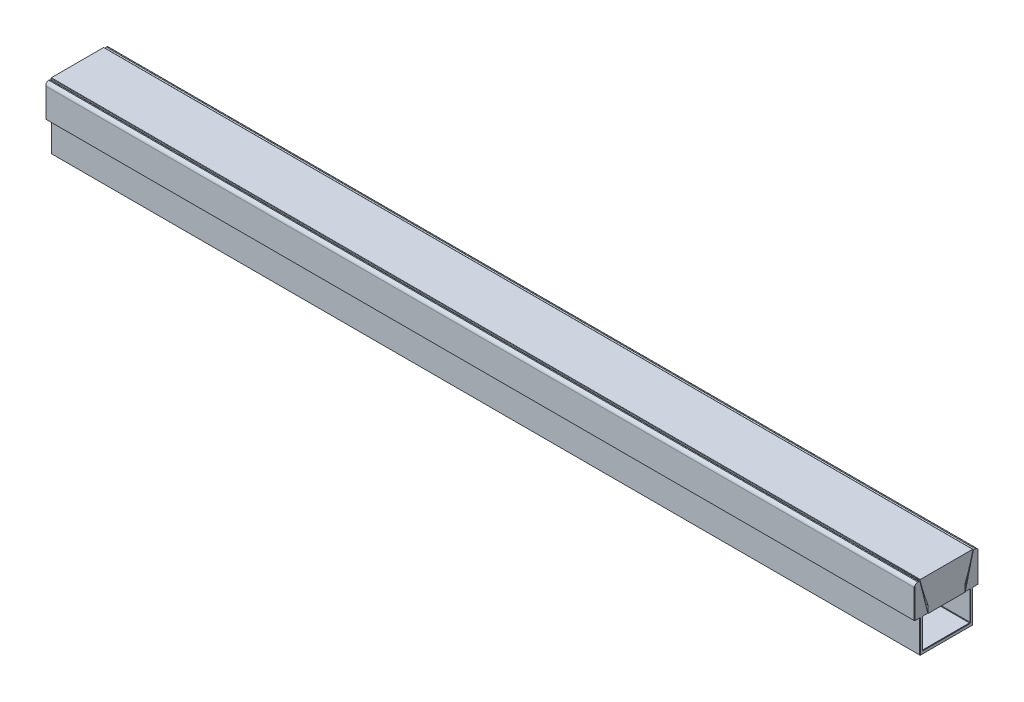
ISO-10303-21;
HEADER;
FILE_DESCRIPTION(('STEP AP214'),'2;1');
FILE_NAME('part.step','',(''),(''),'','','');
FILE_SCHEMA(('AUTOMOTIVE_DESIGN { 1 0 10303 214 1 1 1 1 }'));
ENDSEC;
DATA;
#1=APPLICATION_CONTEXT('core data for automotive mechanical design processes');
#2=APPLICATION_PROTOCOL_DEFINITION('international standard','automotive_design',2000,#1);
#3=PRODUCT_CONTEXT('',#1,'mechanical');
#4=PRODUCT('Part','Part','',(#3));
#5=PRODUCT_RELATED_PRODUCT_CATEGORY('part','',(#4));
#6=PRODUCT_DEFINITION_FORMATION('','',#4);
#7=PRODUCT_DEFINITION_CONTEXT('part definition',#1,'design');
#8=PRODUCT_DEFINITION('design','',#6,#7);
#9=PRODUCT_DEFINITION_SHAPE('','',#8);
#10=(LENGTH_UNIT() NAMED_UNIT(*) SI_UNIT(.MILLI.,.METRE.));
#11=(NAMED_UNIT(*) PLANE_ANGLE_UNIT() SI_UNIT($,.RADIAN.));
#12=(NAMED_UNIT(*) SI_UNIT($,.STERADIAN.) SOLID_ANGLE_UNIT());
#13=UNCERTAINTY_MEASURE_WITH_UNIT(LENGTH_MEASURE(1.E-05),#10,'distance_accuracy_value','');
#14=(GEOMETRIC_REPRESENTATION_CONTEXT(3) GLOBAL_UNCERTAINTY_ASSIGNED_CONTEXT((#13)) GLOBAL_UNIT_ASSIGNED_CONTEXT((#10,
#11,#12)) REPRESENTATION_CONTEXT('',''));
#15=CARTESIAN_POINT('',(0.,0.,0.));
#16=DIRECTION('',(0.,0.,1.));
#17=DIRECTION('',(1.,0.,0.));
#18=AXIS2_PLACEMENT_3D('',#15,#16,#17);
#19=CARTESIAN_POINT('',(254.,38.6,0.));
#20=DIRECTION('',(1.,0.,0.));
#21=DIRECTION('',(0.,0.,-1.));
#22=AXIS2_PLACEMENT_3D('',#19,#20,#21);
#23=PLANE('',#22);
#24=DIRECTION('',(0.,1.,0.));
#25=VECTOR('',#24,1.);
#26=CARTESIAN_POINT('',(254.,19.1,-10.705));
#27=LINE('',#26,#25);
#28=CARTESIAN_POINT('',(254.,19.1,-10.705));
#29=VERTEX_POINT('',#28);
#30=CARTESIAN_POINT('',(254.,23.1,-10.705));
#31=VERTEX_POINT('',#30);
#32=EDGE_CURVE('P0_E94',#29,#31,#27,.T.);
#33=ORIENTED_EDGE('',*,*,#32,.T.);
#34=CARTESIAN_POINT('',(254.,69.0468844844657,108.296730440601));
#35=DIRECTION('',(1.,0.,0.));
#36=DIRECTION('',(0.,0.,1.));
#37=AXIS2_PLACEMENT_3D('',#34,#35,#36);
#38=CIRCLE('',#37,127.563819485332);
#39=CARTESIAN_POINT('',(254.,38.1,-15.4563235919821));
#40=VERTEX_POINT('',#39);
#41=EDGE_CURVE('P0_E105',#31,#40,#38,.T.);
#42=ORIENTED_EDGE('',*,*,#41,.T.);
#43=DIRECTION('',(0.,-1.,0.));
#44=VECTOR('',#43,1.);
#45=CARTESIAN_POINT('',(254.,38.6,-15.4563235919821));
#46=LINE('',#45,#44);
#47=CARTESIAN_POINT('',(254.,38.4,-15.4563235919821));
#48=VERTEX_POINT('',#47);
#49=EDGE_CURVE('P0_E128',#48,#40,#46,.T.);
#50=ORIENTED_EDGE('',*,*,#49,.F.);
#51=CARTESIAN_POINT('',(254.,38.4,-15.2563235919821));
#52=DIRECTION('',(1.,0.,0.));
#53=DIRECTION('',(0.,0.,-1.));
#54=AXIS2_PLACEMENT_3D('',#51,#52,#53);
#55=CIRCLE('',#54,0.2);
#56=CARTESIAN_POINT('',(254.,38.6,-15.2563235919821));
#57=VERTEX_POINT('',#56);
#58=EDGE_CURVE('P0_E153',#48,#57,#55,.T.);
#59=ORIENTED_EDGE('',*,*,#58,.T.);
#60=DIRECTION('',(0.,0.,1.));
#61=VECTOR('',#60,1.);
#62=CARTESIAN_POINT('',(254.,38.6,0.));
#63=LINE('',#62,#61);
#64=CARTESIAN_POINT('',(254.,38.6,15.2563235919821));
#65=VERTEX_POINT('',#64);
#66=EDGE_CURVE('P0_E132',#57,#65,#63,.T.);
#67=ORIENTED_EDGE('',*,*,#66,.T.);
#68=CARTESIAN_POINT('',(254.,38.4,15.2563235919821));
#69=DIRECTION('',(1.,0.,0.));
#70=DIRECTION('',(0.,0.,-1.));
#71=AXIS2_PLACEMENT_3D('',#68,#69,#70);
#72=CIRCLE('',#71,0.2);
#73=CARTESIAN_POINT('',(254.,38.4,15.4563235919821));
#74=VERTEX_POINT('',#73);
#75=EDGE_CURVE('P0_E24',#65,#74,#72,.T.);
#76=ORIENTED_EDGE('',*,*,#75,.T.);
#77=DIRECTION('',(0.,-1.,0.));
#78=VECTOR('',#77,1.);
#79=CARTESIAN_POINT('',(254.,38.6,15.4563235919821));
#80=LINE('',#79,#78);
#81=CARTESIAN_POINT('',(254.,38.1,15.4563235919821));
#82=VERTEX_POINT('',#81);
#83=EDGE_CURVE('P0_E116',#74,#82,#80,.T.);
#84=ORIENTED_EDGE('',*,*,#83,.T.);
#85=CARTESIAN_POINT('',(254.,69.0468844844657,-108.296730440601));
#86=DIRECTION('',(-1.,0.,0.));
#87=DIRECTION('',(0.,0.,-1.));
#88=AXIS2_PLACEMENT_3D('',#85,#86,#87);
#89=CIRCLE('',#88,127.563819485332);
#90=CARTESIAN_POINT('',(254.,23.1,10.705));
#91=VERTEX_POINT('',#90);
#92=EDGE_CURVE('P0_E182',#91,#82,#89,.T.);
#93=ORIENTED_EDGE('',*,*,#92,.F.);
#94=DIRECTION('',(0.,1.,0.));
#95=VECTOR('',#94,1.);
#96=CARTESIAN_POINT('',(254.,19.1,10.705));
#97=LINE('',#96,#95);
#98=CARTESIAN_POINT('',(254.,19.1,10.705));
#99=VERTEX_POINT('',#98);
#100=EDGE_CURVE('P0_E112',#99,#91,#97,.T.);
#101=ORIENTED_EDGE('',*,*,#100,.F.);
#102=DIRECTION('',(0.,0.,-1.));
#103=VECTOR('',#102,1.);
#104=CARTESIAN_POINT('',(254.,19.1,10.705));
#105=LINE('',#104,#103);
#106=EDGE_CURVE('P0_E109',#99,#29,#105,.T.);
#107=ORIENTED_EDGE('',*,*,#106,.T.);
#108=EDGE_LOOP('',(#33,#42,#50,#59,#67,#76,#84,#93,#101,#107));
#109=FACE_BOUND('',#108,.T.);
#110=ADVANCED_FACE('P0_F16',(#109),#23,.T.);
#111=CARTESIAN_POINT('',(-254.,38.6,0.));
#112=DIRECTION('',(1.,0.,0.));
#113=DIRECTION('',(0.,0.,-1.));
#114=AXIS2_PLACEMENT_3D('',#111,#112,#113);
#115=PLANE('',#114);
#116=CARTESIAN_POINT('',(-254.,69.0468844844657,108.296730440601));
#117=DIRECTION('',(1.,0.,0.));
#118=DIRECTION('',(0.,0.,-1.));
#119=AXIS2_PLACEMENT_3D('',#116,#117,#118);
#120=CIRCLE('',#119,127.563819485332);
#121=CARTESIAN_POINT('',(-254.,38.1,-15.4563235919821));
#122=VERTEX_POINT('',#121);
#123=CARTESIAN_POINT('',(-254.,23.1,-10.705));
#124=VERTEX_POINT('',#123);
#125=EDGE_CURVE('P0_E188',#122,#124,#120,.F.);
#126=ORIENTED_EDGE('',*,*,#125,.T.);
#127=DIRECTION('',(0.,-1.,0.));
#128=VECTOR('',#127,1.);
#129=CARTESIAN_POINT('',(-254.,19.1,-10.705));
#130=LINE('',#129,#128);
#131=CARTESIAN_POINT('',(-254.,19.1,-10.705));
#132=VERTEX_POINT('',#131);
#133=EDGE_CURVE('P0_E185',#124,#132,#130,.T.);
#134=ORIENTED_EDGE('',*,*,#133,.T.);
#135=DIRECTION('',(0.,0.,-1.));
#136=VECTOR('',#135,1.);
#137=CARTESIAN_POINT('',(-254.,19.1,10.705));
#138=LINE('',#137,#136);
#139=CARTESIAN_POINT('',(-254.,19.1,10.705));
#140=VERTEX_POINT('',#139);
#141=EDGE_CURVE('P0_E121',#140,#132,#138,.T.);
#142=ORIENTED_EDGE('',*,*,#141,.F.);
#143=DIRECTION('',(0.,-1.,0.));
#144=VECTOR('',#143,1.);
#145=CARTESIAN_POINT('',(-254.,19.1,10.705));
#146=LINE('',#145,#144);
#147=CARTESIAN_POINT('',(-254.,23.1,10.705));
#148=VERTEX_POINT('',#147);
#149=EDGE_CURVE('P0_E177',#148,#140,#146,.T.);
#150=ORIENTED_EDGE('',*,*,#149,.F.);
#151=CARTESIAN_POINT('',(-254.,69.0468844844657,-108.296730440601));
#152=DIRECTION('',(1.,0.,0.));
#153=DIRECTION('',(0.,0.,-1.));
#154=AXIS2_PLACEMENT_3D('',#151,#152,#153);
#155=CIRCLE('',#154,127.563819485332);
#156=CARTESIAN_POINT('',(-254.,38.1,15.4563235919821));
#157=VERTEX_POINT('',#156);
#158=EDGE_CURVE('P0_E175',#157,#148,#155,.T.);
#159=ORIENTED_EDGE('',*,*,#158,.F.);
#160=DIRECTION('',(0.,-1.,0.));
#161=VECTOR('',#160,1.);
#162=CARTESIAN_POINT('',(-254.,38.6,15.4563235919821));
#163=LINE('',#162,#161);
#164=CARTESIAN_POINT('',(-254.,38.4,15.4563235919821));
#165=VERTEX_POINT('',#164);
#166=EDGE_CURVE('P0_E125',#165,#157,#163,.T.);
#167=ORIENTED_EDGE('',*,*,#166,.F.);
#168=CARTESIAN_POINT('',(-254.,38.4,15.2563235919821));
#169=DIRECTION('',(1.,0.,0.));
#170=DIRECTION('',(0.,0.,-1.));
#171=AXIS2_PLACEMENT_3D('',#168,#169,#170);
#172=CIRCLE('',#171,0.2);
#173=CARTESIAN_POINT('',(-254.,38.6,15.2563235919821));
#174=VERTEX_POINT('',#173);
#175=EDGE_CURVE('P0_E147',#165,#174,#172,.F.);
#176=ORIENTED_EDGE('',*,*,#175,.T.);
#177=DIRECTION('',(0.,0.,1.));
#178=VECTOR('',#177,1.);
#179=CARTESIAN_POINT('',(-254.,38.6,0.));
#180=LINE('',#179,#178);
#181=CARTESIAN_POINT('',(-254.,38.6,-15.2563235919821));
#182=VERTEX_POINT('',#181);
#183=EDGE_CURVE('P0_E122',#182,#174,#180,.T.);
#184=ORIENTED_EDGE('',*,*,#183,.F.);
#185=CARTESIAN_POINT('',(-254.,38.4,-15.2563235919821));
#186=DIRECTION('',(1.,0.,0.));
#187=DIRECTION('',(0.,0.,-1.));
#188=AXIS2_PLACEMENT_3D('',#185,#186,#187);
#189=CIRCLE('',#188,0.2);
#190=CARTESIAN_POINT('',(-254.,38.4,-15.4563235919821));
#191=VERTEX_POINT('',#190);
#192=EDGE_CURVE('P0_E145',#182,#191,#189,.F.);
#193=ORIENTED_EDGE('',*,*,#192,.T.);
#194=DIRECTION('',(0.,-1.,0.));
#195=VECTOR('',#194,1.);
#196=CARTESIAN_POINT('',(-254.,38.6,-15.4563235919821));
#197=LINE('',#196,#195);
#198=EDGE_CURVE('P0_E173',#191,#122,#197,.T.);
#199=ORIENTED_EDGE('',*,*,#198,.T.);
#200=EDGE_LOOP('',(#126,#134,#142,#150,#159,#167,#176,#184,#193,#199));
#201=FACE_BOUND('',#200,.T.);
#202=ADVANCED_FACE('P0_F166',(#201),#115,.F.);
#203=CARTESIAN_POINT('',(254.,38.6,0.));
#204=DIRECTION('',(0.,-1.,0.));
#205=DIRECTION('',(0.,0.,-1.));
#206=AXIS2_PLACEMENT_3D('',#203,#204,#205);
#207=PLANE('',#206);
#208=ORIENTED_EDGE('',*,*,#183,.T.);
#209=DIRECTION('',(-1.,0.,0.));
#210=VECTOR('',#209,1.);
#211=CARTESIAN_POINT('',(254.,38.6,15.2563235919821));
#212=LINE('',#211,#210);
#213=EDGE_CURVE('P0_E37',#174,#65,#212,.F.);
#214=ORIENTED_EDGE('',*,*,#213,.T.);
#215=ORIENTED_EDGE('',*,*,#66,.F.);
#216=DIRECTION('',(-1.,0.,0.));
#217=VECTOR('',#216,1.);
#218=CARTESIAN_POINT('',(-254.,38.6,-15.2563235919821));
#219=LINE('',#218,#217);
#220=EDGE_CURVE('P0_E149',#57,#182,#219,.T.);
#221=ORIENTED_EDGE('',*,*,#220,.T.);
#222=EDGE_LOOP('',(#208,#214,#215,#221));
#223=FACE_BOUND('',#222,.T.);
#224=ADVANCED_FACE('P0_F168',(#223),#207,.F.);
#225=CARTESIAN_POINT('',(254.,38.6,15.4563235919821));
#226=DIRECTION('',(0.,0.,-1.));
#227=DIRECTION('',(-1.,0.,0.));
#228=AXIS2_PLACEMENT_3D('',#225,#226,#227);
#229=PLANE('',#228);
#230=ORIENTED_EDGE('',*,*,#83,.F.);
#231=DIRECTION('',(-1.,0.,0.));
#232=VECTOR('',#231,1.);
#233=CARTESIAN_POINT('',(254.,38.4,15.4563235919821));
#234=LINE('',#233,#232);
#235=EDGE_CURVE('P0_E142',#74,#165,#234,.T.);
#236=ORIENTED_EDGE('',*,*,#235,.T.);
#237=ORIENTED_EDGE('',*,*,#166,.T.);
#238=DIRECTION('',(-1.,0.,0.));
#239=VECTOR('',#238,1.);
#240=CARTESIAN_POINT('',(254.,38.1,15.4563235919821));
#241=LINE('',#240,#239);
#242=EDGE_CURVE('P0_E140',#82,#157,#241,.T.);
#243=ORIENTED_EDGE('',*,*,#242,.F.);
#244=EDGE_LOOP('',(#230,#236,#237,#243));
#245=FACE_BOUND('',#244,.T.);
#246=ADVANCED_FACE('P0_F160',(#245),#229,.F.);
#247=CARTESIAN_POINT('',(254.,19.1,10.705));
#248=DIRECTION('',(0.,1.,0.));
#249=DIRECTION('',(0.,0.,1.));
#250=AXIS2_PLACEMENT_3D('',#247,#248,#249);
#251=PLANE('',#250);
#252=ORIENTED_EDGE('',*,*,#141,.T.);
#253=DIRECTION('',(-1.,0.,0.));
#254=VECTOR('',#253,1.);
#255=CARTESIAN_POINT('',(254.,19.1,-10.705));
#256=LINE('',#255,#254);
#257=EDGE_CURVE('P0_E98',#29,#132,#256,.T.);
#258=ORIENTED_EDGE('',*,*,#257,.F.);
#259=ORIENTED_EDGE('',*,*,#106,.F.);
#260=DIRECTION('',(-1.,0.,0.));
#261=VECTOR('',#260,1.);
#262=CARTESIAN_POINT('',(254.,19.1,10.705));
#263=LINE('',#262,#261);
#264=EDGE_CURVE('P0_E115',#99,#140,#263,.T.);
#265=ORIENTED_EDGE('',*,*,#264,.T.);
#266=EDGE_LOOP('',(#252,#258,#259,#265));
#267=FACE_BOUND('',#266,.T.);
#268=ADVANCED_FACE('P0_F119',(#267),#251,.F.);
#269=CARTESIAN_POINT('',(254.,38.6,-15.4563235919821));
#270=DIRECTION('',(0.,0.,-1.));
#271=DIRECTION('',(-1.,0.,0.));
#272=AXIS2_PLACEMENT_3D('',#269,#270,#271);
#273=PLANE('',#272);
#274=ORIENTED_EDGE('',*,*,#198,.F.);
#275=DIRECTION('',(-1.,0.,0.));
#276=VECTOR('',#275,1.);
#277=CARTESIAN_POINT('',(254.,38.4,-15.4563235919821));
#278=LINE('',#277,#276);
#279=EDGE_CURVE('P0_E11',#191,#48,#278,.F.);
#280=ORIENTED_EDGE('',*,*,#279,.T.);
#281=ORIENTED_EDGE('',*,*,#49,.T.);
#282=DIRECTION('',(-1.,0.,0.));
#283=VECTOR('',#282,1.);
#284=CARTESIAN_POINT('',(254.,38.1,-15.4563235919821));
#285=LINE('',#284,#283);
#286=EDGE_CURVE('P0_E123',#40,#122,#285,.T.);
#287=ORIENTED_EDGE('',*,*,#286,.T.);
#288=EDGE_LOOP('',(#274,#280,#281,#287));
#289=FACE_BOUND('',#288,.T.);
#290=ADVANCED_FACE('P0_F174',(#289),#273,.T.);
#291=CARTESIAN_POINT('',(254.,38.4,15.2563235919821));
#292=DIRECTION('',(-1.,0.,0.));
#293=DIRECTION('',(0.,0.,1.));
#294=AXIS2_PLACEMENT_3D('',#291,#292,#293);
#295=CYLINDRICAL_SURFACE('',#294,0.2);
#296=ORIENTED_EDGE('',*,*,#75,.F.);
#297=ORIENTED_EDGE('',*,*,#213,.F.);
#298=ORIENTED_EDGE('',*,*,#175,.F.);
#299=ORIENTED_EDGE('',*,*,#235,.F.);
#300=EDGE_LOOP('',(#296,#297,#298,#299));
#301=FACE_BOUND('',#300,.T.);
#302=ADVANCED_FACE('P0_F162',(#301),#295,.T.);
#303=CARTESIAN_POINT('',(254.,38.4,-15.2563235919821));
#304=DIRECTION('',(1.,0.,0.));
#305=DIRECTION('',(0.,0.,-1.));
#306=AXIS2_PLACEMENT_3D('',#303,#304,#305);
#307=CYLINDRICAL_SURFACE('',#306,0.2);
#308=ORIENTED_EDGE('',*,*,#58,.F.);
#309=ORIENTED_EDGE('',*,*,#279,.F.);
#310=ORIENTED_EDGE('',*,*,#192,.F.);
#311=ORIENTED_EDGE('',*,*,#220,.F.);
#312=EDGE_LOOP('',(#308,#309,#310,#311));
#313=FACE_BOUND('',#312,.T.);
#314=ADVANCED_FACE('P0_F18',(#313),#307,.T.);
#315=CARTESIAN_POINT('',(-273.585072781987,19.1,10.705));
#316=DIRECTION('',(0.,0.,-1.));
#317=DIRECTION('',(-1.,0.,0.));
#318=AXIS2_PLACEMENT_3D('',#315,#316,#317);
#319=PLANE('',#318);
#320=ORIENTED_EDGE('',*,*,#149,.T.);
#321=ORIENTED_EDGE('',*,*,#264,.F.);
#322=ORIENTED_EDGE('',*,*,#100,.T.);
#323=DIRECTION('',(1.,0.,0.));
#324=VECTOR('',#323,1.);
#325=CARTESIAN_POINT('',(-273.585072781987,23.1,10.705));
#326=LINE('',#325,#324);
#327=EDGE_CURVE('P0_E180',#148,#91,#326,.T.);
#328=ORIENTED_EDGE('',*,*,#327,.F.);
#329=EDGE_LOOP('',(#320,#321,#322,#328));
#330=FACE_BOUND('',#329,.T.);
#331=ADVANCED_FACE('P0_F202',(#330),#319,.F.);
#332=CARTESIAN_POINT('',(-273.585072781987,69.0468844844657,-108.296730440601));
#333=DIRECTION('',(1.,0.,0.));
#334=DIRECTION('',(0.,0.,-1.));
#335=AXIS2_PLACEMENT_3D('',#332,#333,#334);
#336=CYLINDRICAL_SURFACE('',#335,127.563819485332);
#337=ORIENTED_EDGE('',*,*,#158,.T.);
#338=ORIENTED_EDGE('',*,*,#327,.T.);
#339=ORIENTED_EDGE('',*,*,#92,.T.);
#340=ORIENTED_EDGE('',*,*,#242,.T.);
#341=EDGE_LOOP('',(#337,#338,#339,#340));
#342=FACE_BOUND('',#341,.T.);
#343=ADVANCED_FACE('P0_F194',(#342),#336,.T.);
#344=CARTESIAN_POINT('',(-273.585072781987,69.0468844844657,108.296730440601));
#345=DIRECTION('',(1.,0.,0.));
#346=DIRECTION('',(0.,0.,-1.));
#347=AXIS2_PLACEMENT_3D('',#344,#345,#346);
#348=CYLINDRICAL_SURFACE('',#347,127.563819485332);
#349=ORIENTED_EDGE('',*,*,#286,.F.);
#350=ORIENTED_EDGE('',*,*,#41,.F.);
#351=DIRECTION('',(1.,0.,0.));
#352=VECTOR('',#351,1.);
#353=CARTESIAN_POINT('',(-273.585072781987,23.1,-10.705));
#354=LINE('',#353,#352);
#355=EDGE_CURVE('P0_E101',#124,#31,#354,.T.);
#356=ORIENTED_EDGE('',*,*,#355,.F.);
#357=ORIENTED_EDGE('',*,*,#125,.F.);
#358=EDGE_LOOP('',(#349,#350,#356,#357));
#359=FACE_BOUND('',#358,.T.);
#360=ADVANCED_FACE('P0_F192',(#359),#348,.T.);
#361=CARTESIAN_POINT('',(-273.585072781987,19.1,-10.705));
#362=DIRECTION('',(0.,0.,-1.));
#363=DIRECTION('',(-1.,0.,0.));
#364=AXIS2_PLACEMENT_3D('',#361,#362,#363);
#365=PLANE('',#364);
#366=ORIENTED_EDGE('',*,*,#355,.T.);
#367=ORIENTED_EDGE('',*,*,#32,.F.);
#368=ORIENTED_EDGE('',*,*,#257,.T.);
#369=ORIENTED_EDGE('',*,*,#133,.F.);
#370=EDGE_LOOP('',(#366,#367,#368,#369));
#371=FACE_BOUND('',#370,.T.);
#372=ADVANCED_FACE('P0_F96',(#371),#365,.T.);
#373=CLOSED_SHELL('',(#110,#202,#224,#246,#268,#290,#302,#314,#331,#343,#360,#372));
#374=MANIFOLD_SOLID_BREP('P0_B1',#373);
#375=CARTESIAN_POINT('',(-254.,0.,0.));
#376=DIRECTION('',(-1.,0.,0.));
#377=DIRECTION('',(0.,0.,1.));
#378=AXIS2_PLACEMENT_3D('',#375,#376,#377);
#379=PLANE('',#378);
#380=CARTESIAN_POINT('',(-254.,36.1,-16.9615528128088));
#381=DIRECTION('',(-1.,0.,0.));
#382=DIRECTION('',(0.,0.,1.));
#383=AXIS2_PLACEMENT_3D('',#380,#381,#382);
#384=CIRCLE('',#383,2.);
#385=CARTESIAN_POINT('',(-254.,37.4637737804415,-15.4986375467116));
#386=VERTEX_POINT('',#385);
#387=CARTESIAN_POINT('',(-254.,38.0939241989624,-16.8057764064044));
#388=VERTEX_POINT('',#387);
#389=EDGE_CURVE('P1_E813',#386,#388,#384,.T.);
#390=ORIENTED_EDGE('',*,*,#389,.T.);
#391=CARTESIAN_POINT('',(-254.,36.1,-16.65));
#392=DIRECTION('',(-1.,0.,0.));
#393=DIRECTION('',(0.,0.,1.));
#394=AXIS2_PLACEMENT_3D('',#391,#392,#393);
#395=CIRCLE('',#394,2.);
#396=CARTESIAN_POINT('',(-254.,37.068245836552,-18.3999999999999));
#397=VERTEX_POINT('',#396);
#398=EDGE_CURVE('P1_E815',#388,#397,#395,.T.);
#399=ORIENTED_EDGE('',*,*,#398,.T.);
#400=DIRECTION('',(0.,-1.,0.));
#401=VECTOR('',#400,1.);
#402=CARTESIAN_POINT('',(-254.,0.,-18.3999999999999));
#403=LINE('',#402,#401);
#404=CARTESIAN_POINT('',(-254.,19.3500000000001,-18.3999999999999));
#405=VERTEX_POINT('',#404);
#406=EDGE_CURVE('P1_E486',#397,#405,#403,.T.);
#407=ORIENTED_EDGE('',*,*,#406,.T.);
#408=DIRECTION('',(0.,0.,1.));
#409=VECTOR('',#408,1.);
#410=CARTESIAN_POINT('',(-254.,19.3500000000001,0.));
#411=LINE('',#410,#409);
#412=CARTESIAN_POINT('',(-254.,19.3500000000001,-15.6500000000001));
#413=VERTEX_POINT('',#412);
#414=EDGE_CURVE('P1_E484',#405,#413,#411,.T.);
#415=ORIENTED_EDGE('',*,*,#414,.T.);
#416=DIRECTION('',(0.,0.707106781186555,-0.70710678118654));
#417=VECTOR('',#416,1.);
#418=CARTESIAN_POINT('',(-254.,1.8499999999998,1.84999999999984));
#419=LINE('',#418,#417);
#420=CARTESIAN_POINT('',(-254.,19.1,-15.4));
#421=VERTEX_POINT('',#420);
#422=EDGE_CURVE('P1_E481',#421,#413,#419,.T.);
#423=ORIENTED_EDGE('',*,*,#422,.F.);
#424=DIRECTION('',(0.,0.707106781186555,-0.70710678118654));
#425=VECTOR('',#424,1.);
#426=CARTESIAN_POINT('',(-254.,1.8499999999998,1.84999999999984));
#427=LINE('',#426,#425);
#428=CARTESIAN_POINT('',(-254.,18.8499999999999,-15.1499999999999));
#429=VERTEX_POINT('',#428);
#430=EDGE_CURVE('P1_E478',#429,#421,#427,.T.);
#431=ORIENTED_EDGE('',*,*,#430,.F.);
#432=DIRECTION('',(0.,-1.,0.));
#433=VECTOR('',#432,1.);
#434=CARTESIAN_POINT('',(-254.,0.,-15.1499999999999));
#435=LINE('',#434,#433);
#436=CARTESIAN_POINT('',(-254.,0.250000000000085,-15.1499999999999));
#437=VERTEX_POINT('',#436);
#438=EDGE_CURVE('P1_E476',#429,#437,#435,.T.);
#439=ORIENTED_EDGE('',*,*,#438,.T.);
#440=DIRECTION('',(0.,0.,1.));
#441=VECTOR('',#440,1.);
#442=CARTESIAN_POINT('',(-254.,0.250000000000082,15.4));
#443=LINE('',#442,#441);
#444=CARTESIAN_POINT('',(-254.,0.250000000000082,15.1499999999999));
#445=VERTEX_POINT('',#444);
#446=EDGE_CURVE('P1_E474',#437,#445,#443,.T.);
#447=ORIENTED_EDGE('',*,*,#446,.T.);
#448=DIRECTION('',(0.,1.,0.));
#449=VECTOR('',#448,1.);
#450=CARTESIAN_POINT('',(-254.,19.1,15.1499999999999));
#451=LINE('',#450,#449);
#452=CARTESIAN_POINT('',(-254.,18.8499999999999,15.1499999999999));
#453=VERTEX_POINT('',#452);
#454=EDGE_CURVE('P1_E472',#445,#453,#451,.T.);
#455=ORIENTED_EDGE('',*,*,#454,.T.);
#456=DIRECTION('',(0.,-0.707106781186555,-0.70710678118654));
#457=VECTOR('',#456,1.);
#458=CARTESIAN_POINT('',(-254.,1.8499999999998,-1.84999999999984));
#459=LINE('',#458,#457);
#460=CARTESIAN_POINT('',(-254.,19.1,15.4));
#461=VERTEX_POINT('',#460);
#462=EDGE_CURVE('P1_E469',#461,#453,#459,.T.);
#463=ORIENTED_EDGE('',*,*,#462,.F.);
#464=DIRECTION('',(0.,-0.707106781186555,-0.70710678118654));
#465=VECTOR('',#464,1.);
#466=CARTESIAN_POINT('',(-254.,1.8499999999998,-1.84999999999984));
#467=LINE('',#466,#465);
#468=CARTESIAN_POINT('',(-254.,19.3500000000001,15.6500000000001));
#469=VERTEX_POINT('',#468);
#470=EDGE_CURVE('P1_E466',#469,#461,#467,.T.);
#471=ORIENTED_EDGE('',*,*,#470,.F.);
#472=DIRECTION('',(0.,0.,1.));
#473=VECTOR('',#472,1.);
#474=CARTESIAN_POINT('',(-254.,19.3500000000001,18.65));
#475=LINE('',#474,#473);
#476=CARTESIAN_POINT('',(-254.,19.3500000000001,18.3999999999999));
#477=VERTEX_POINT('',#476);
#478=EDGE_CURVE('P1_E464',#469,#477,#475,.T.);
#479=ORIENTED_EDGE('',*,*,#478,.T.);
#480=DIRECTION('',(0.,1.,0.));
#481=VECTOR('',#480,1.);
#482=CARTESIAN_POINT('',(-254.,38.1,18.3999999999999));
#483=LINE('',#482,#481);
#484=CARTESIAN_POINT('',(-254.,37.068245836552,18.3999999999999));
#485=VERTEX_POINT('',#484);
#486=EDGE_CURVE('P1_E461',#477,#485,#483,.T.);
#487=ORIENTED_EDGE('',*,*,#486,.T.);
#488=CARTESIAN_POINT('',(-254.,36.1,16.65));
#489=DIRECTION('',(-1.,0.,0.));
#490=DIRECTION('',(0.,0.,1.));
#491=AXIS2_PLACEMENT_3D('',#488,#489,#490);
#492=CIRCLE('',#491,2.);
#493=CARTESIAN_POINT('',(-254.,38.0939241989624,16.8057764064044));
#494=VERTEX_POINT('',#493);
#495=EDGE_CURVE('P1_E811',#485,#494,#492,.T.);
#496=ORIENTED_EDGE('',*,*,#495,.T.);
#497=CARTESIAN_POINT('',(-254.,36.1,16.9615528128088));
#498=DIRECTION('',(-1.,0.,0.));
#499=DIRECTION('',(0.,0.,1.));
#500=AXIS2_PLACEMENT_3D('',#497,#498,#499);
#501=CIRCLE('',#500,2.);
#502=CARTESIAN_POINT('',(-254.,37.4637737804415,15.4986375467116));
#503=VERTEX_POINT('',#502);
#504=EDGE_CURVE('P1_E604',#494,#503,#501,.T.);
#505=ORIENTED_EDGE('',*,*,#504,.T.);
#506=DIRECTION('',(0.,-0.970142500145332,-0.242535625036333));
#507=VECTOR('',#506,1.);
#508=CARTESIAN_POINT('',(-254.,19.0393660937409,10.8925356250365));
#509=LINE('',#508,#507);
#510=CARTESIAN_POINT('',(-254.,19.3500000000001,10.9701941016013));
#511=VERTEX_POINT('',#510);
#512=EDGE_CURVE('P1_E488',#503,#511,#509,.T.);
#513=ORIENTED_EDGE('',*,*,#512,.T.);
#514=DIRECTION('',(0.,0.,1.));
#515=VECTOR('',#514,1.);
#516=CARTESIAN_POINT('',(-254.,19.3500000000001,13.9));
#517=LINE('',#516,#515);
#518=CARTESIAN_POINT('',(-254.,19.3500000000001,13.6499999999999));
#519=VERTEX_POINT('',#518);
#520=EDGE_CURVE('P1_E490',#511,#519,#517,.T.);
#521=ORIENTED_EDGE('',*,*,#520,.T.);
#522=DIRECTION('',(0.,0.707106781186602,-0.707106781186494));
#523=VECTOR('',#522,1.);
#524=CARTESIAN_POINT('',(-254.,16.4999999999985,16.5000000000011));
#525=LINE('',#524,#523);
#526=CARTESIAN_POINT('',(-254.,19.1,13.9));
#527=VERTEX_POINT('',#526);
#528=EDGE_CURVE('P1_E492',#527,#519,#525,.T.);
#529=ORIENTED_EDGE('',*,*,#528,.F.);
#530=DIRECTION('',(0.,0.707106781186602,-0.707106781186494));
#531=VECTOR('',#530,1.);
#532=CARTESIAN_POINT('',(-254.,16.4999999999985,16.5000000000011));
#533=LINE('',#532,#531);
#534=CARTESIAN_POINT('',(-254.,18.8499999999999,14.1500000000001));
#535=VERTEX_POINT('',#534);
#536=EDGE_CURVE('P1_E495',#535,#527,#533,.T.);
#537=ORIENTED_EDGE('',*,*,#536,.F.);
#538=DIRECTION('',(0.,-1.,0.));
#539=VECTOR('',#538,1.);
#540=CARTESIAN_POINT('',(-254.,2.,14.1500000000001));
#541=LINE('',#540,#539);
#542=CARTESIAN_POINT('',(-254.,2.25000000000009,14.1500000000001));
#543=VERTEX_POINT('',#542);
#544=EDGE_CURVE('P1_E498',#535,#543,#541,.T.);
#545=ORIENTED_EDGE('',*,*,#544,.T.);
#546=DIRECTION('',(0.,0.707106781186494,0.707106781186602));
#547=VECTOR('',#546,1.);
#548=CARTESIAN_POINT('',(-254.,-5.94999999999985,5.94999999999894));
#549=LINE('',#548,#547);
#550=CARTESIAN_POINT('',(-254.,2.,13.9));
#551=VERTEX_POINT('',#550);
#552=EDGE_CURVE('P1_E500',#551,#543,#549,.T.);
#553=ORIENTED_EDGE('',*,*,#552,.F.);
#554=DIRECTION('',(0.,0.707106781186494,0.707106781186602));
#555=VECTOR('',#554,1.);
#556=CARTESIAN_POINT('',(-254.,-5.94999999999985,5.94999999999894));
#557=LINE('',#556,#555);
#558=CARTESIAN_POINT('',(-254.,1.74999999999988,13.6499999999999));
#559=VERTEX_POINT('',#558);
#560=EDGE_CURVE('P1_E503',#559,#551,#557,.T.);
#561=ORIENTED_EDGE('',*,*,#560,.F.);
#562=DIRECTION('',(0.,0.,-1.));
#563=VECTOR('',#562,1.);
#564=CARTESIAN_POINT('',(-254.,1.74999999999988,-13.9));
#565=LINE('',#564,#563);
#566=CARTESIAN_POINT('',(-254.,1.74999999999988,-13.6499999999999));
#567=VERTEX_POINT('',#566);
#568=EDGE_CURVE('P1_E506',#559,#567,#565,.T.);
#569=ORIENTED_EDGE('',*,*,#568,.T.);
#570=DIRECTION('',(0.,-0.707106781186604,0.707106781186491));
#571=VECTOR('',#570,1.);
#572=CARTESIAN_POINT('',(-254.,-5.95000000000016,-5.95000000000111));
#573=LINE('',#572,#571);
#574=CARTESIAN_POINT('',(-254.,2.,-13.9));
#575=VERTEX_POINT('',#574);
#576=EDGE_CURVE('P1_E508',#575,#567,#573,.T.);
#577=ORIENTED_EDGE('',*,*,#576,.F.);
#578=DIRECTION('',(0.,-0.707106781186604,0.707106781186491));
#579=VECTOR('',#578,1.);
#580=CARTESIAN_POINT('',(-254.,-5.95000000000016,-5.95000000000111));
#581=LINE('',#580,#579);
#582=CARTESIAN_POINT('',(-254.,2.25000000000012,-14.1500000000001));
#583=VERTEX_POINT('',#582);
#584=EDGE_CURVE('P1_E511',#583,#575,#581,.T.);
#585=ORIENTED_EDGE('',*,*,#584,.F.);
#586=DIRECTION('',(0.,1.,0.));
#587=VECTOR('',#586,1.);
#588=CARTESIAN_POINT('',(-254.,0.,-14.1500000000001));
#589=LINE('',#588,#587);
#590=CARTESIAN_POINT('',(-254.,18.8499999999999,-14.1500000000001));
#591=VERTEX_POINT('',#590);
#592=EDGE_CURVE('P1_E514',#583,#591,#589,.T.);
#593=ORIENTED_EDGE('',*,*,#592,.T.);
#594=DIRECTION('',(0.,-0.707106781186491,-0.707106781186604));
#595=VECTOR('',#594,1.);
#596=CARTESIAN_POINT('',(-254.,16.5000000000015,-16.4999999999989));
#597=LINE('',#596,#595);
#598=CARTESIAN_POINT('',(-254.,19.1,-13.9));
#599=VERTEX_POINT('',#598);
#600=EDGE_CURVE('P1_E516',#599,#591,#597,.T.);
#601=ORIENTED_EDGE('',*,*,#600,.F.);
#602=DIRECTION('',(0.,-0.707106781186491,-0.707106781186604));
#603=VECTOR('',#602,1.);
#604=CARTESIAN_POINT('',(-254.,16.5000000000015,-16.4999999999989));
#605=LINE('',#604,#603);
#606=CARTESIAN_POINT('',(-254.,19.3500000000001,-13.6499999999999));
#607=VERTEX_POINT('',#606);
#608=EDGE_CURVE('P1_E519',#607,#599,#605,.T.);
#609=ORIENTED_EDGE('',*,*,#608,.F.);
#610=DIRECTION('',(0.,0.,1.));
#611=VECTOR('',#610,1.);
#612=CARTESIAN_POINT('',(-254.,19.3500000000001,0.));
#613=LINE('',#612,#611);
#614=CARTESIAN_POINT('',(-254.,19.3500000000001,-10.9701941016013));
#615=VERTEX_POINT('',#614);
#616=EDGE_CURVE('P1_E522',#607,#615,#613,.T.);
#617=ORIENTED_EDGE('',*,*,#616,.T.);
#618=DIRECTION('',(0.,0.970142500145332,-0.242535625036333));
#619=VECTOR('',#618,1.);
#620=CARTESIAN_POINT('',(-254.,-1.44298684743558,-5.77194738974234));
#621=LINE('',#620,#619);
#622=EDGE_CURVE('P1_E524',#615,#386,#621,.T.);
#623=ORIENTED_EDGE('',*,*,#622,.T.);
#624=EDGE_LOOP('',(#390,#399,#407,#415,#423,#431,#439,#447,#455,#463,#471,#479,#487,#496,#505,
#513,#521,#529,#537,#545,#553,#561,#569,#577,#585,#593,#601,#609,#617,#623));
#625=FACE_BOUND('',#624,.T.);
#626=ADVANCED_FACE('P1_F15',(#625),#379,.T.);
#627=CARTESIAN_POINT('',(254.,0.,0.));
#628=DIRECTION('',(-1.,0.,0.));
#629=DIRECTION('',(0.,0.,1.));
#630=AXIS2_PLACEMENT_3D('',#627,#628,#629);
#631=PLANE('',#630);
#632=DIRECTION('',(0.,1.,0.));
#633=VECTOR('',#632,1.);
#634=CARTESIAN_POINT('',(254.,38.1,-18.3999999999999));
#635=LINE('',#634,#633);
#636=CARTESIAN_POINT('',(254.,19.3500000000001,-18.3999999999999));
#637=VERTEX_POINT('',#636);
#638=CARTESIAN_POINT('',(254.,37.068245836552,-18.3999999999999));
#639=VERTEX_POINT('',#638);
#640=EDGE_CURVE('P1_E399',#637,#639,#635,.T.);
#641=ORIENTED_EDGE('',*,*,#640,.T.);
#642=CARTESIAN_POINT('',(254.,36.1,-16.65));
#643=DIRECTION('',(-1.,0.,0.));
#644=DIRECTION('',(0.,0.,1.));
#645=AXIS2_PLACEMENT_3D('',#642,#643,#644);
#646=CIRCLE('',#645,2.);
#647=CARTESIAN_POINT('',(254.,38.0939241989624,-16.8057764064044));
#648=VERTEX_POINT('',#647);
#649=EDGE_CURVE('P1_E830',#639,#648,#646,.F.);
#650=ORIENTED_EDGE('',*,*,#649,.T.);
#651=CARTESIAN_POINT('',(254.,36.1,-16.9615528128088));
#652=DIRECTION('',(-1.,0.,0.));
#653=DIRECTION('',(0.,0.,1.));
#654=AXIS2_PLACEMENT_3D('',#651,#652,#653);
#655=CIRCLE('',#654,2.);
#656=CARTESIAN_POINT('',(254.,37.4637737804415,-15.4986375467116));
#657=VERTEX_POINT('',#656);
#658=EDGE_CURVE('P1_E828',#648,#657,#655,.F.);
#659=ORIENTED_EDGE('',*,*,#658,.T.);
#660=DIRECTION('',(0.,-0.970142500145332,0.242535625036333));
#661=VECTOR('',#660,1.);
#662=CARTESIAN_POINT('',(254.,19.0393660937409,-10.8925356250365));
#663=LINE('',#662,#661);
#664=CARTESIAN_POINT('',(254.,19.3500000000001,-10.9701941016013));
#665=VERTEX_POINT('',#664);
#666=EDGE_CURVE('P1_E430',#657,#665,#663,.T.);
#667=ORIENTED_EDGE('',*,*,#666,.T.);
#668=DIRECTION('',(0.,0.,-1.));
#669=VECTOR('',#668,1.);
#670=CARTESIAN_POINT('',(254.,19.3500000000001,-13.9));
#671=LINE('',#670,#669);
#672=CARTESIAN_POINT('',(254.,19.3500000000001,-13.6499999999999));
#673=VERTEX_POINT('',#672);
#674=EDGE_CURVE('P1_E426',#665,#673,#671,.T.);
#675=ORIENTED_EDGE('',*,*,#674,.T.);
#676=DIRECTION('',(0.,0.707106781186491,0.707106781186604));
#677=VECTOR('',#676,1.);
#678=CARTESIAN_POINT('',(254.,19.35,-13.6499999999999));
#679=LINE('',#678,#677);
#680=CARTESIAN_POINT('',(254.,19.1,-13.9));
#681=VERTEX_POINT('',#680);
#682=EDGE_CURVE('P1_E423',#681,#673,#679,.T.);
#683=ORIENTED_EDGE('',*,*,#682,.F.);
#684=DIRECTION('',(0.,0.707106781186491,0.707106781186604));
#685=VECTOR('',#684,1.);
#686=CARTESIAN_POINT('',(254.,19.35,-13.6499999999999));
#687=LINE('',#686,#685);
#688=CARTESIAN_POINT('',(254.,18.8499999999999,-14.1500000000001));
#689=VERTEX_POINT('',#688);
#690=EDGE_CURVE('P1_E414',#689,#681,#687,.T.);
#691=ORIENTED_EDGE('',*,*,#690,.F.);
#692=DIRECTION('',(0.,-1.,0.));
#693=VECTOR('',#692,1.);
#694=CARTESIAN_POINT('',(254.,2.,-14.1500000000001));
#695=LINE('',#694,#693);
#696=CARTESIAN_POINT('',(254.,2.25000000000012,-14.1500000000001));
#697=VERTEX_POINT('',#696);
#698=EDGE_CURVE('P1_E410',#689,#697,#695,.T.);
#699=ORIENTED_EDGE('',*,*,#698,.T.);
#700=DIRECTION('',(0.,0.707106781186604,-0.707106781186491));
#701=VECTOR('',#700,1.);
#702=CARTESIAN_POINT('',(254.,2.25000000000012,-14.1500000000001));
#703=LINE('',#702,#701);
#704=CARTESIAN_POINT('',(254.,2.,-13.9));
#705=VERTEX_POINT('',#704);
#706=EDGE_CURVE('P1_E404',#705,#697,#703,.T.);
#707=ORIENTED_EDGE('',*,*,#706,.F.);
#708=DIRECTION('',(0.,0.707106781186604,-0.707106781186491));
#709=VECTOR('',#708,1.);
#710=CARTESIAN_POINT('',(254.,2.25000000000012,-14.1500000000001));
#711=LINE('',#710,#709);
#712=CARTESIAN_POINT('',(254.,1.74999999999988,-13.6499999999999));
#713=VERTEX_POINT('',#712);
#714=EDGE_CURVE('P1_E407',#713,#705,#711,.T.);
#715=ORIENTED_EDGE('',*,*,#714,.F.);
#716=DIRECTION('',(0.,0.,1.));
#717=VECTOR('',#716,1.);
#718=CARTESIAN_POINT('',(254.,1.74999999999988,0.));
#719=LINE('',#718,#717);
#720=CARTESIAN_POINT('',(254.,1.74999999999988,13.6499999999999));
#721=VERTEX_POINT('',#720);
#722=EDGE_CURVE('P1_E412',#713,#721,#719,.T.);
#723=ORIENTED_EDGE('',*,*,#722,.T.);
#724=DIRECTION('',(0.,-0.707106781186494,-0.707106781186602));
#725=VECTOR('',#724,1.);
#726=CARTESIAN_POINT('',(254.,1.74999999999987,13.6499999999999));
#727=LINE('',#726,#725);
#728=CARTESIAN_POINT('',(254.,2.,13.9));
#729=VERTEX_POINT('',#728);
#730=EDGE_CURVE('P1_E417',#729,#721,#727,.T.);
#731=ORIENTED_EDGE('',*,*,#730,.F.);
#732=DIRECTION('',(0.,-0.707106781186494,-0.707106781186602));
#733=VECTOR('',#732,1.);
#734=CARTESIAN_POINT('',(254.,1.74999999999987,13.6499999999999));
#735=LINE('',#734,#733);
#736=CARTESIAN_POINT('',(254.,2.25000000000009,14.1500000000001));
#737=VERTEX_POINT('',#736);
#738=EDGE_CURVE('P1_E420',#737,#729,#735,.T.);
#739=ORIENTED_EDGE('',*,*,#738,.F.);
#740=DIRECTION('',(0.,1.,0.));
#741=VECTOR('',#740,1.);
#742=CARTESIAN_POINT('',(254.,0.,14.1500000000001));
#743=LINE('',#742,#741);
#744=CARTESIAN_POINT('',(254.,18.8499999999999,14.1500000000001));
#745=VERTEX_POINT('',#744);
#746=EDGE_CURVE('P1_E428',#737,#745,#743,.T.);
#747=ORIENTED_EDGE('',*,*,#746,.T.);
#748=DIRECTION('',(0.,-0.707106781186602,0.707106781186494));
#749=VECTOR('',#748,1.);
#750=CARTESIAN_POINT('',(254.,18.8499999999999,14.1500000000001));
#751=LINE('',#750,#749);
#752=CARTESIAN_POINT('',(254.,19.1,13.9));
#753=VERTEX_POINT('',#752);
#754=EDGE_CURVE('P1_E432',#753,#745,#751,.T.);
#755=ORIENTED_EDGE('',*,*,#754,.F.);
#756=DIRECTION('',(0.,-0.707106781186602,0.707106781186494));
#757=VECTOR('',#756,1.);
#758=CARTESIAN_POINT('',(254.,18.8499999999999,14.1500000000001));
#759=LINE('',#758,#757);
#760=CARTESIAN_POINT('',(254.,19.3500000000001,13.6499999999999));
#761=VERTEX_POINT('',#760);
#762=EDGE_CURVE('P1_E435',#761,#753,#759,.T.);
#763=ORIENTED_EDGE('',*,*,#762,.F.);
#764=DIRECTION('',(0.,0.,-1.));
#765=VECTOR('',#764,1.);
#766=CARTESIAN_POINT('',(254.,19.3500000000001,0.));
#767=LINE('',#766,#765);
#768=CARTESIAN_POINT('',(254.,19.3500000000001,10.9701941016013));
#769=VERTEX_POINT('',#768);
#770=EDGE_CURVE('P1_E438',#761,#769,#767,.T.);
#771=ORIENTED_EDGE('',*,*,#770,.T.);
#772=DIRECTION('',(0.,0.970142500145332,0.242535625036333));
#773=VECTOR('',#772,1.);
#774=CARTESIAN_POINT('',(254.,-1.44298684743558,5.77194738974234));
#775=LINE('',#774,#773);
#776=CARTESIAN_POINT('',(254.,37.4637737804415,15.4986375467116));
#777=VERTEX_POINT('',#776);
#778=EDGE_CURVE('P1_E440',#769,#777,#775,.T.);
#779=ORIENTED_EDGE('',*,*,#778,.T.);
#780=CARTESIAN_POINT('',(254.,36.1,16.9615528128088));
#781=DIRECTION('',(-1.,0.,0.));
#782=DIRECTION('',(0.,0.,1.));
#783=AXIS2_PLACEMENT_3D('',#780,#781,#782);
#784=CIRCLE('',#783,2.);
#785=CARTESIAN_POINT('',(254.,38.0939241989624,16.8057764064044));
#786=VERTEX_POINT('',#785);
#787=EDGE_CURVE('P1_E824',#777,#786,#784,.F.);
#788=ORIENTED_EDGE('',*,*,#787,.T.);
#789=CARTESIAN_POINT('',(254.,36.1,16.65));
#790=DIRECTION('',(-1.,0.,0.));
#791=DIRECTION('',(0.,0.,1.));
#792=AXIS2_PLACEMENT_3D('',#789,#790,#791);
#793=CIRCLE('',#792,2.);
#794=CARTESIAN_POINT('',(254.,37.068245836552,18.3999999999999));
#795=VERTEX_POINT('',#794);
#796=EDGE_CURVE('P1_E826',#786,#795,#793,.F.);
#797=ORIENTED_EDGE('',*,*,#796,.T.);
#798=DIRECTION('',(0.,-1.,0.));
#799=VECTOR('',#798,1.);
#800=CARTESIAN_POINT('',(254.,0.,18.3999999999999));
#801=LINE('',#800,#799);
#802=CARTESIAN_POINT('',(254.,19.3500000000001,18.3999999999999));
#803=VERTEX_POINT('',#802);
#804=EDGE_CURVE('P1_E896',#795,#803,#801,.T.);
#805=ORIENTED_EDGE('',*,*,#804,.T.);
#806=DIRECTION('',(0.,0.,-1.));
#807=VECTOR('',#806,1.);
#808=CARTESIAN_POINT('',(254.,19.3500000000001,0.));
#809=LINE('',#808,#807);
#810=CARTESIAN_POINT('',(254.,19.3500000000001,15.6500000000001));
#811=VERTEX_POINT('',#810);
#812=EDGE_CURVE('P1_E898',#803,#811,#809,.T.);
#813=ORIENTED_EDGE('',*,*,#812,.T.);
#814=DIRECTION('',(0.,0.707106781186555,0.70710678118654));
#815=VECTOR('',#814,1.);
#816=CARTESIAN_POINT('',(254.,19.3500000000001,15.6500000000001));
#817=LINE('',#816,#815);
#818=CARTESIAN_POINT('',(254.,19.1,15.4));
#819=VERTEX_POINT('',#818);
#820=EDGE_CURVE('P1_E901',#819,#811,#817,.T.);
#821=ORIENTED_EDGE('',*,*,#820,.F.);
#822=DIRECTION('',(0.,0.707106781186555,0.70710678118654));
#823=VECTOR('',#822,1.);
#824=CARTESIAN_POINT('',(254.,19.3500000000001,15.6500000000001));
#825=LINE('',#824,#823);
#826=CARTESIAN_POINT('',(254.,18.8499999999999,15.1499999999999));
#827=VERTEX_POINT('',#826);
#828=EDGE_CURVE('P1_E904',#827,#819,#825,.T.);
#829=ORIENTED_EDGE('',*,*,#828,.F.);
#830=DIRECTION('',(0.,-1.,0.));
#831=VECTOR('',#830,1.);
#832=CARTESIAN_POINT('',(254.,0.,15.1499999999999));
#833=LINE('',#832,#831);
#834=CARTESIAN_POINT('',(254.,0.250000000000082,15.1499999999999));
#835=VERTEX_POINT('',#834);
#836=EDGE_CURVE('P1_E907',#827,#835,#833,.T.);
#837=ORIENTED_EDGE('',*,*,#836,.T.);
#838=DIRECTION('',(0.,0.,-1.));
#839=VECTOR('',#838,1.);
#840=CARTESIAN_POINT('',(254.,0.250000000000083,0.));
#841=LINE('',#840,#839);
#842=CARTESIAN_POINT('',(254.,0.250000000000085,-15.1499999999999));
#843=VERTEX_POINT('',#842);
#844=EDGE_CURVE('P1_E909',#835,#843,#841,.T.);
#845=ORIENTED_EDGE('',*,*,#844,.T.);
#846=DIRECTION('',(0.,1.,0.));
#847=VECTOR('',#846,1.);
#848=CARTESIAN_POINT('',(254.,19.1,-15.1499999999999));
#849=LINE('',#848,#847);
#850=CARTESIAN_POINT('',(254.,18.8499999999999,-15.1499999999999));
#851=VERTEX_POINT('',#850);
#852=EDGE_CURVE('P1_E388',#843,#851,#849,.T.);
#853=ORIENTED_EDGE('',*,*,#852,.T.);
#854=DIRECTION('',(0.,-0.707106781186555,0.70710678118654));
#855=VECTOR('',#854,1.);
#856=CARTESIAN_POINT('',(254.,18.8499999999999,-15.1499999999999));
#857=LINE('',#856,#855);
#858=CARTESIAN_POINT('',(254.,19.1,-15.4));
#859=VERTEX_POINT('',#858);
#860=EDGE_CURVE('P1_E381',#859,#851,#857,.T.);
#861=ORIENTED_EDGE('',*,*,#860,.F.);
#862=DIRECTION('',(0.,-0.707106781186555,0.70710678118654));
#863=VECTOR('',#862,1.);
#864=CARTESIAN_POINT('',(254.,18.8499999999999,-15.1499999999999));
#865=LINE('',#864,#863);
#866=CARTESIAN_POINT('',(254.,19.3500000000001,-15.6500000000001));
#867=VERTEX_POINT('',#866);
#868=EDGE_CURVE('P1_E385',#867,#859,#865,.T.);
#869=ORIENTED_EDGE('',*,*,#868,.F.);
#870=DIRECTION('',(0.,0.,-1.));
#871=VECTOR('',#870,1.);
#872=CARTESIAN_POINT('',(254.,19.3500000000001,-18.65));
#873=LINE('',#872,#871);
#874=EDGE_CURVE('P1_E397',#867,#637,#873,.T.);
#875=ORIENTED_EDGE('',*,*,#874,.T.);
#876=EDGE_LOOP('',(#641,#650,#659,#667,#675,#683,#691,#699,#707,#715,#723,#731,#739,#747,#755,
#763,#771,#779,#788,#797,#805,#813,#821,#829,#837,#845,#853,#861,#869,#875));
#877=FACE_BOUND('',#876,.T.);
#878=ADVANCED_FACE('P1_F384',(#877),#631,.F.);
#879=CARTESIAN_POINT('',(254.,2.,13.9));
#880=DIRECTION('',(0.,-1.,0.));
#881=DIRECTION('',(0.,0.,-1.));
#882=AXIS2_PLACEMENT_3D('',#879,#880,#881);
#883=PLANE('',#882);
#884=DIRECTION('',(1.,0.,0.));
#885=VECTOR('',#884,1.);
#886=CARTESIAN_POINT('',(254.,2.,13.6499999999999));
#887=LINE('',#886,#885);
#888=CARTESIAN_POINT('',(-253.75,2.,13.6499999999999));
#889=VERTEX_POINT('',#888);
#890=CARTESIAN_POINT('',(253.75,2.,13.6499999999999));
#891=VERTEX_POINT('',#890);
#892=EDGE_CURVE('P1_E583',#889,#891,#887,.T.);
#893=ORIENTED_EDGE('',*,*,#892,.T.);
#894=DIRECTION('',(0.,0.,-1.));
#895=VECTOR('',#894,1.);
#896=CARTESIAN_POINT('',(253.75,2.,13.9));
#897=LINE('',#896,#895);
#898=CARTESIAN_POINT('',(253.75,2.,-13.6499999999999));
#899=VERTEX_POINT('',#898);
#900=EDGE_CURVE('P1_E585',#891,#899,#897,.T.);
#901=ORIENTED_EDGE('',*,*,#900,.T.);
#902=DIRECTION('',(-1.,0.,0.));
#903=VECTOR('',#902,1.);
#904=CARTESIAN_POINT('',(254.,2.,-13.6499999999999));
#905=LINE('',#904,#903);
#906=CARTESIAN_POINT('',(-253.75,2.,-13.6499999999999));
#907=VERTEX_POINT('',#906);
#908=EDGE_CURVE('P1_E581',#899,#907,#905,.T.);
#909=ORIENTED_EDGE('',*,*,#908,.T.);
#910=DIRECTION('',(0.,0.,1.));
#911=VECTOR('',#910,1.);
#912=CARTESIAN_POINT('',(-253.75,2.,13.9));
#913=LINE('',#912,#911);
#914=EDGE_CURVE('P1_E579',#907,#889,#913,.T.);
#915=ORIENTED_EDGE('',*,*,#914,.T.);
#916=EDGE_LOOP('',(#893,#901,#909,#915));
#917=FACE_BOUND('',#916,.T.);
#918=ADVANCED_FACE('P1_F1059',(#917),#883,.F.);
#919=CARTESIAN_POINT('',(254.,19.1,13.9));
#920=DIRECTION('',(0.,0.,1.));
#921=DIRECTION('',(0.,-1.,0.));
#922=AXIS2_PLACEMENT_3D('',#919,#920,#921);
#923=PLANE('',#922);
#924=DIRECTION('',(1.,0.,0.));
#925=VECTOR('',#924,1.);
#926=CARTESIAN_POINT('',(254.,18.8499999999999,13.9));
#927=LINE('',#926,#925);
#928=CARTESIAN_POINT('',(-253.75,18.8499999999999,13.9));
#929=VERTEX_POINT('',#928);
#930=CARTESIAN_POINT('',(253.75,18.8499999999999,13.9));
#931=VERTEX_POINT('',#930);
#932=EDGE_CURVE('P1_E574',#929,#931,#927,.T.);
#933=ORIENTED_EDGE('',*,*,#932,.T.);
#934=DIRECTION('',(0.,-1.,0.));
#935=VECTOR('',#934,1.);
#936=CARTESIAN_POINT('',(253.75,19.1,13.9));
#937=LINE('',#936,#935);
#938=CARTESIAN_POINT('',(253.75,2.25000000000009,13.9));
#939=VERTEX_POINT('',#938);
#940=EDGE_CURVE('P1_E576',#931,#939,#937,.T.);
#941=ORIENTED_EDGE('',*,*,#940,.T.);
#942=DIRECTION('',(-1.,0.,0.));
#943=VECTOR('',#942,1.);
#944=CARTESIAN_POINT('',(-254.,2.25000000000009,13.9));
#945=LINE('',#944,#943);
#946=CARTESIAN_POINT('',(-253.75,2.25000000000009,13.9));
#947=VERTEX_POINT('',#946);
#948=EDGE_CURVE('P1_E572',#939,#947,#945,.T.);
#949=ORIENTED_EDGE('',*,*,#948,.T.);
#950=DIRECTION('',(0.,1.,0.));
#951=VECTOR('',#950,1.);
#952=CARTESIAN_POINT('',(-253.75,19.1,13.9));
#953=LINE('',#952,#951);
#954=EDGE_CURVE('P1_E570',#947,#929,#953,.T.);
#955=ORIENTED_EDGE('',*,*,#954,.T.);
#956=EDGE_LOOP('',(#933,#941,#949,#955));
#957=FACE_BOUND('',#956,.T.);
#958=ADVANCED_FACE('P1_F1083',(#957),#923,.F.);
#959=CARTESIAN_POINT('',(254.,19.1,10.65));
#960=DIRECTION('',(0.,1.,0.));
#961=DIRECTION('',(0.,0.,1.));
#962=AXIS2_PLACEMENT_3D('',#959,#960,#961);
#963=PLANE('',#962);
#964=DIRECTION('',(0.,0.,-1.));
#965=VECTOR('',#964,1.);
#966=CARTESIAN_POINT('',(-253.75,19.1,10.65));
#967=LINE('',#966,#965);
#968=CARTESIAN_POINT('',(-253.75,19.1,13.6499999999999));
#969=VERTEX_POINT('',#968);
#970=CARTESIAN_POINT('',(-253.75,19.1,10.9));
#971=VERTEX_POINT('',#970);
#972=EDGE_CURVE('P1_E875',#969,#971,#967,.T.);
#973=ORIENTED_EDGE('',*,*,#972,.T.);
#974=DIRECTION('',(1.,0.,0.));
#975=VECTOR('',#974,1.);
#976=CARTESIAN_POINT('',(254.,19.1,10.9));
#977=LINE('',#976,#975);
#978=CARTESIAN_POINT('',(253.75,19.1,10.9));
#979=VERTEX_POINT('',#978);
#980=EDGE_CURVE('P1_E878',#971,#979,#977,.T.);
#981=ORIENTED_EDGE('',*,*,#980,.T.);
#982=DIRECTION('',(0.,0.,1.));
#983=VECTOR('',#982,1.);
#984=CARTESIAN_POINT('',(253.75,19.1,10.65));
#985=LINE('',#984,#983);
#986=CARTESIAN_POINT('',(253.75,19.1,13.6499999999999));
#987=VERTEX_POINT('',#986);
#988=EDGE_CURVE('P1_E884',#979,#987,#985,.T.);
#989=ORIENTED_EDGE('',*,*,#988,.T.);
#990=DIRECTION('',(-1.,0.,0.));
#991=VECTOR('',#990,1.);
#992=CARTESIAN_POINT('',(-254.,19.1,13.6499999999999));
#993=LINE('',#992,#991);
#994=EDGE_CURVE('P1_E888',#987,#969,#993,.T.);
#995=ORIENTED_EDGE('',*,*,#994,.T.);
#996=EDGE_LOOP('',(#973,#981,#989,#995));
#997=FACE_BOUND('',#996,.T.);
#998=ADVANCED_FACE('P1_F1080',(#997),#963,.F.);
#999=CARTESIAN_POINT('',(254.,38.1,15.4));
#1000=DIRECTION('',(0.,-0.242535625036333,0.970142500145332));
#1001=DIRECTION('',(0.,-0.970142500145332,-0.242535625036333));
#1002=AXIS2_PLACEMENT_3D('',#999,#1000,#1001);
#1003=PLANE('',#1002);
#1004=DIRECTION('',(0.,0.970142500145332,0.242535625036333));
#1005=VECTOR('',#1004,1.);
#1006=CARTESIAN_POINT('',(-253.75,38.1,15.4));
#1007=LINE('',#1006,#1005);
#1008=CARTESIAN_POINT('',(-253.75,19.3,10.7));
#1009=VERTEX_POINT('',#1008);
#1010=CARTESIAN_POINT('',(-253.75,36.5850712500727,15.0212678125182));
#1011=VERTEX_POINT('',#1010);
#1012=EDGE_CURVE('P1_E710',#1009,#1011,#1007,.T.);
#1013=ORIENTED_EDGE('',*,*,#1012,.T.);
#1014=DIRECTION('',(-1.,0.,0.));
#1015=VECTOR('',#1014,1.);
#1016=CARTESIAN_POINT('',(254.,36.5850712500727,15.0212678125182));
#1017=LINE('',#1016,#1015);
#1018=CARTESIAN_POINT('',(253.75,36.5850712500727,15.0212678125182));
#1019=VERTEX_POINT('',#1018);
#1020=EDGE_CURVE('P1_E24',#1011,#1019,#1017,.F.);
#1021=ORIENTED_EDGE('',*,*,#1020,.T.);
#1022=DIRECTION('',(0.,-0.970142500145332,-0.242535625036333));
#1023=VECTOR('',#1022,1.);
#1024=CARTESIAN_POINT('',(253.75,38.1,15.4));
#1025=LINE('',#1024,#1023);
#1026=CARTESIAN_POINT('',(253.75,19.3,10.7));
#1027=VERTEX_POINT('',#1026);
#1028=EDGE_CURVE('P1_E1838',#1019,#1027,#1025,.T.);
#1029=ORIENTED_EDGE('',*,*,#1028,.T.);
#1030=DIRECTION('',(-1.,0.,0.));
#1031=VECTOR('',#1030,1.);
#1032=CARTESIAN_POINT('',(254.,19.3,10.7));
#1033=LINE('',#1032,#1031);
#1034=EDGE_CURVE('P1_E1837',#1027,#1009,#1033,.T.);
#1035=ORIENTED_EDGE('',*,*,#1034,.T.);
#1036=EDGE_LOOP('',(#1013,#1021,#1029,#1035));
#1037=FACE_BOUND('',#1036,.T.);
#1038=ADVANCED_FACE('P1_F1076',(#1037),#1003,.F.);
#1039=CARTESIAN_POINT('',(254.,19.1,18.65));
#1040=DIRECTION('',(0.,0.,-1.));
#1041=DIRECTION('',(-1.,0.,0.));
#1042=AXIS2_PLACEMENT_3D('',#1039,#1040,#1041);
#1043=PLANE('',#1042);
#1044=DIRECTION('',(0.,1.,0.));
#1045=VECTOR('',#1044,1.);
#1046=CARTESIAN_POINT('',(253.75,19.1,18.65));
#1047=LINE('',#1046,#1045);
#1048=CARTESIAN_POINT('',(253.75,19.3500000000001,18.65));
#1049=VERTEX_POINT('',#1048);
#1050=CARTESIAN_POINT('',(253.75,36.1,18.65));
#1051=VERTEX_POINT('',#1050);
#1052=EDGE_CURVE('P1_E601',#1049,#1051,#1047,.T.);
#1053=ORIENTED_EDGE('',*,*,#1052,.T.);
#1054=DIRECTION('',(-1.,0.,0.));
#1055=VECTOR('',#1054,1.);
#1056=CARTESIAN_POINT('',(254.,36.1,18.65));
#1057=LINE('',#1056,#1055);
#1058=CARTESIAN_POINT('',(-253.75,36.1,18.65));
#1059=VERTEX_POINT('',#1058);
#1060=EDGE_CURVE('P1_E838',#1051,#1059,#1057,.T.);
#1061=ORIENTED_EDGE('',*,*,#1060,.T.);
#1062=DIRECTION('',(0.,-1.,0.));
#1063=VECTOR('',#1062,1.);
#1064=CARTESIAN_POINT('',(-253.75,19.1,18.65));
#1065=LINE('',#1064,#1063);
#1066=CARTESIAN_POINT('',(-253.75,19.3500000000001,18.65));
#1067=VERTEX_POINT('',#1066);
#1068=EDGE_CURVE('P1_E597',#1059,#1067,#1065,.T.);
#1069=ORIENTED_EDGE('',*,*,#1068,.T.);
#1070=DIRECTION('',(1.,0.,0.));
#1071=VECTOR('',#1070,1.);
#1072=CARTESIAN_POINT('',(254.,19.3500000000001,18.65));
#1073=LINE('',#1072,#1071);
#1074=EDGE_CURVE('P1_E599',#1067,#1049,#1073,.T.);
#1075=ORIENTED_EDGE('',*,*,#1074,.T.);
#1076=EDGE_LOOP('',(#1053,#1061,#1069,#1075));
#1077=FACE_BOUND('',#1076,.T.);
#1078=ADVANCED_FACE('P1_F1072',(#1077),#1043,.F.);
#1079=CARTESIAN_POINT('',(254.,19.1,15.4));
#1080=DIRECTION('',(0.,1.,0.));
#1081=DIRECTION('',(0.,0.,1.));
#1082=AXIS2_PLACEMENT_3D('',#1079,#1080,#1081);
#1083=PLANE('',#1082);
#1084=DIRECTION('',(0.,0.,-1.));
#1085=VECTOR('',#1084,1.);
#1086=CARTESIAN_POINT('',(-253.75,19.1,15.4));
#1087=LINE('',#1086,#1085);
#1088=CARTESIAN_POINT('',(-253.75,19.1,18.3999999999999));
#1089=VERTEX_POINT('',#1088);
#1090=CARTESIAN_POINT('',(-253.75,19.1,15.6500000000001));
#1091=VERTEX_POINT('',#1090);
#1092=EDGE_CURVE('P1_E454',#1089,#1091,#1087,.T.);
#1093=ORIENTED_EDGE('',*,*,#1092,.T.);
#1094=DIRECTION('',(1.,0.,0.));
#1095=VECTOR('',#1094,1.);
#1096=CARTESIAN_POINT('',(254.,19.1,15.6500000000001));
#1097=LINE('',#1096,#1095);
#1098=CARTESIAN_POINT('',(253.75,19.1,15.6500000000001));
#1099=VERTEX_POINT('',#1098);
#1100=EDGE_CURVE('P1_E459',#1091,#1099,#1097,.T.);
#1101=ORIENTED_EDGE('',*,*,#1100,.T.);
#1102=DIRECTION('',(0.,0.,1.));
#1103=VECTOR('',#1102,1.);
#1104=CARTESIAN_POINT('',(253.75,19.1,15.4));
#1105=LINE('',#1104,#1103);
#1106=CARTESIAN_POINT('',(253.75,19.1,18.3999999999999));
#1107=VERTEX_POINT('',#1106);
#1108=EDGE_CURVE('P1_E456',#1099,#1107,#1105,.T.);
#1109=ORIENTED_EDGE('',*,*,#1108,.T.);
#1110=DIRECTION('',(-1.,0.,0.));
#1111=VECTOR('',#1110,1.);
#1112=CARTESIAN_POINT('',(254.,19.1,18.3999999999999));
#1113=LINE('',#1112,#1111);
#1114=EDGE_CURVE('P1_E452',#1107,#1089,#1113,.T.);
#1115=ORIENTED_EDGE('',*,*,#1114,.T.);
#1116=EDGE_LOOP('',(#1093,#1101,#1109,#1115));
#1117=FACE_BOUND('',#1116,.T.);
#1118=ADVANCED_FACE('P1_F1068',(#1117),#1083,.F.);
#1119=CARTESIAN_POINT('',(254.,0.,15.4));
#1120=DIRECTION('',(0.,0.,-1.));
#1121=DIRECTION('',(0.,1.,0.));
#1122=AXIS2_PLACEMENT_3D('',#1119,#1120,#1121);
#1123=PLANE('',#1122);
#1124=DIRECTION('',(1.,0.,0.));
#1125=VECTOR('',#1124,1.);
#1126=CARTESIAN_POINT('',(254.,0.250000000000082,15.4));
#1127=LINE('',#1126,#1125);
#1128=CARTESIAN_POINT('',(-253.75,0.250000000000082,15.4));
#1129=VERTEX_POINT('',#1128);
#1130=CARTESIAN_POINT('',(253.75,0.250000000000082,15.4));
#1131=VERTEX_POINT('',#1130);
#1132=EDGE_CURVE('P1_E538',#1129,#1131,#1127,.T.);
#1133=ORIENTED_EDGE('',*,*,#1132,.T.);
#1134=DIRECTION('',(0.,1.,0.));
#1135=VECTOR('',#1134,1.);
#1136=CARTESIAN_POINT('',(253.75,0.,15.4));
#1137=LINE('',#1136,#1135);
#1138=CARTESIAN_POINT('',(253.75,18.8499999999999,15.4));
#1139=VERTEX_POINT('',#1138);
#1140=EDGE_CURVE('P1_E542',#1131,#1139,#1137,.T.);
#1141=ORIENTED_EDGE('',*,*,#1140,.T.);
#1142=DIRECTION('',(-1.,0.,0.));
#1143=VECTOR('',#1142,1.);
#1144=CARTESIAN_POINT('',(-254.,18.8499999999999,15.4));
#1145=LINE('',#1144,#1143);
#1146=CARTESIAN_POINT('',(-253.75,18.8499999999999,15.4));
#1147=VERTEX_POINT('',#1146);
#1148=EDGE_CURVE('P1_E540',#1139,#1147,#1145,.T.);
#1149=ORIENTED_EDGE('',*,*,#1148,.T.);
#1150=DIRECTION('',(0.,-1.,0.));
#1151=VECTOR('',#1150,1.);
#1152=CARTESIAN_POINT('',(-253.75,0.,15.4));
#1153=LINE('',#1152,#1151);
#1154=EDGE_CURVE('P1_E536',#1147,#1129,#1153,.T.);
#1155=ORIENTED_EDGE('',*,*,#1154,.T.);
#1156=EDGE_LOOP('',(#1133,#1141,#1149,#1155));
#1157=FACE_BOUND('',#1156,.T.);
#1158=ADVANCED_FACE('P1_F1065',(#1157),#1123,.F.);
#1159=CARTESIAN_POINT('',(254.,0.,0.));
#1160=DIRECTION('',(0.,1.,0.));
#1161=DIRECTION('',(0.,0.,1.));
#1162=AXIS2_PLACEMENT_3D('',#1159,#1160,#1161);
#1163=PLANE('',#1162);
#1164=DIRECTION('',(0.,0.,1.));
#1165=VECTOR('',#1164,1.);
#1166=CARTESIAN_POINT('',(253.75,0.,0.));
#1167=LINE('',#1166,#1165);
#1168=CARTESIAN_POINT('',(253.75,0.,-15.1499999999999));
#1169=VERTEX_POINT('',#1168);
#1170=CARTESIAN_POINT('',(253.75,0.,15.1499999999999));
#1171=VERTEX_POINT('',#1170);
#1172=EDGE_CURVE('P1_E556',#1169,#1171,#1167,.T.);
#1173=ORIENTED_EDGE('',*,*,#1172,.T.);
#1174=DIRECTION('',(-1.,0.,0.));
#1175=VECTOR('',#1174,1.);
#1176=CARTESIAN_POINT('',(254.,0.,15.1499999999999));
#1177=LINE('',#1176,#1175);
#1178=CARTESIAN_POINT('',(-253.75,0.,15.1499999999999));
#1179=VERTEX_POINT('',#1178);
#1180=EDGE_CURVE('P1_E558',#1171,#1179,#1177,.T.);
#1181=ORIENTED_EDGE('',*,*,#1180,.T.);
#1182=DIRECTION('',(0.,0.,-1.));
#1183=VECTOR('',#1182,1.);
#1184=CARTESIAN_POINT('',(-253.75,0.,-15.4));
#1185=LINE('',#1184,#1183);
#1186=CARTESIAN_POINT('',(-253.75,0.,-15.1499999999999));
#1187=VERTEX_POINT('',#1186);
#1188=EDGE_CURVE('P1_E552',#1179,#1187,#1185,.T.);
#1189=ORIENTED_EDGE('',*,*,#1188,.T.);
#1190=DIRECTION('',(1.,0.,0.));
#1191=VECTOR('',#1190,1.);
#1192=CARTESIAN_POINT('',(254.,0.,-15.1499999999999));
#1193=LINE('',#1192,#1191);
#1194=EDGE_CURVE('P1_E554',#1187,#1169,#1193,.T.);
#1195=ORIENTED_EDGE('',*,*,#1194,.T.);
#1196=EDGE_LOOP('',(#1173,#1181,#1189,#1195));
#1197=FACE_BOUND('',#1196,.T.);
#1198=ADVANCED_FACE('P1_F927',(#1197),#1163,.F.);
#1199=CARTESIAN_POINT('',(254.,0.,-15.4));
#1200=DIRECTION('',(0.,0.,-1.));
#1201=DIRECTION('',(0.,1.,0.));
#1202=AXIS2_PLACEMENT_3D('',#1199,#1200,#1201);
#1203=PLANE('',#1202);
#1204=DIRECTION('',(1.,0.,0.));
#1205=VECTOR('',#1204,1.);
#1206=CARTESIAN_POINT('',(254.,18.8499999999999,-15.4));
#1207=LINE('',#1206,#1205);
#1208=CARTESIAN_POINT('',(-253.75,18.8499999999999,-15.4));
#1209=VERTEX_POINT('',#1208);
#1210=CARTESIAN_POINT('',(253.75,18.8499999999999,-15.4));
#1211=VERTEX_POINT('',#1210);
#1212=EDGE_CURVE('P1_E563',#1209,#1211,#1207,.T.);
#1213=ORIENTED_EDGE('',*,*,#1212,.T.);
#1214=DIRECTION('',(0.,-1.,0.));
#1215=VECTOR('',#1214,1.);
#1216=CARTESIAN_POINT('',(253.75,0.,-15.4));
#1217=LINE('',#1216,#1215);
#1218=CARTESIAN_POINT('',(253.75,0.250000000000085,-15.4));
#1219=VERTEX_POINT('',#1218);
#1220=EDGE_CURVE('P1_E567',#1211,#1219,#1217,.T.);
#1221=ORIENTED_EDGE('',*,*,#1220,.T.);
#1222=DIRECTION('',(-1.,0.,0.));
#1223=VECTOR('',#1222,1.);
#1224=CARTESIAN_POINT('',(-254.,0.250000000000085,-15.4));
#1225=LINE('',#1224,#1223);
#1226=CARTESIAN_POINT('',(-253.75,0.250000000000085,-15.4));
#1227=VERTEX_POINT('',#1226);
#1228=EDGE_CURVE('P1_E565',#1219,#1227,#1225,.T.);
#1229=ORIENTED_EDGE('',*,*,#1228,.T.);
#1230=DIRECTION('',(0.,1.,0.));
#1231=VECTOR('',#1230,1.);
#1232=CARTESIAN_POINT('',(-253.75,0.,-15.4));
#1233=LINE('',#1232,#1231);
#1234=EDGE_CURVE('P1_E561',#1227,#1209,#1233,.T.);
#1235=ORIENTED_EDGE('',*,*,#1234,.T.);
#1236=EDGE_LOOP('',(#1213,#1221,#1229,#1235));
#1237=FACE_BOUND('',#1236,.T.);
#1238=ADVANCED_FACE('P1_F953',(#1237),#1203,.T.);
#1239=CARTESIAN_POINT('',(254.,19.1,-15.4));
#1240=DIRECTION('',(0.,-1.,0.));
#1241=DIRECTION('',(0.,0.,-1.));
#1242=AXIS2_PLACEMENT_3D('',#1239,#1240,#1241);
#1243=PLANE('',#1242);
#1244=DIRECTION('',(1.,0.,0.));
#1245=VECTOR('',#1244,1.);
#1246=CARTESIAN_POINT('',(254.,19.1,-18.3999999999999));
#1247=LINE('',#1246,#1245);
#1248=CARTESIAN_POINT('',(-253.75,19.1,-18.3999999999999));
#1249=VERTEX_POINT('',#1248);
#1250=CARTESIAN_POINT('',(253.75,19.1,-18.3999999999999));
#1251=VERTEX_POINT('',#1250);
#1252=EDGE_CURVE('P1_E529',#1249,#1251,#1247,.T.);
#1253=ORIENTED_EDGE('',*,*,#1252,.T.);
#1254=DIRECTION('',(0.,0.,1.));
#1255=VECTOR('',#1254,1.);
#1256=CARTESIAN_POINT('',(253.75,19.1,-15.4));
#1257=LINE('',#1256,#1255);
#1258=CARTESIAN_POINT('',(253.75,19.1,-15.6500000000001));
#1259=VERTEX_POINT('',#1258);
#1260=EDGE_CURVE('P1_E533',#1251,#1259,#1257,.T.);
#1261=ORIENTED_EDGE('',*,*,#1260,.T.);
#1262=DIRECTION('',(-1.,0.,0.));
#1263=VECTOR('',#1262,1.);
#1264=CARTESIAN_POINT('',(-254.,19.1,-15.6500000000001));
#1265=LINE('',#1264,#1263);
#1266=CARTESIAN_POINT('',(-253.75,19.1,-15.6500000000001));
#1267=VERTEX_POINT('',#1266);
#1268=EDGE_CURVE('P1_E531',#1259,#1267,#1265,.T.);
#1269=ORIENTED_EDGE('',*,*,#1268,.T.);
#1270=DIRECTION('',(0.,0.,-1.));
#1271=VECTOR('',#1270,1.);
#1272=CARTESIAN_POINT('',(-253.75,19.1,-15.4));
#1273=LINE('',#1272,#1271);
#1274=EDGE_CURVE('P1_E527',#1267,#1249,#1273,.T.);
#1275=ORIENTED_EDGE('',*,*,#1274,.T.);
#1276=EDGE_LOOP('',(#1253,#1261,#1269,#1275));
#1277=FACE_BOUND('',#1276,.T.);
#1278=ADVANCED_FACE('P1_F1637',(#1277),#1243,.T.);
#1279=CARTESIAN_POINT('',(254.,19.1,-18.65));
#1280=DIRECTION('',(0.,0.,-1.));
#1281=DIRECTION('',(-1.,0.,0.));
#1282=AXIS2_PLACEMENT_3D('',#1279,#1280,#1281);
#1283=PLANE('',#1282);
#1284=DIRECTION('',(0.,1.,0.));
#1285=VECTOR('',#1284,1.);
#1286=CARTESIAN_POINT('',(-253.75,19.1,-18.65));
#1287=LINE('',#1286,#1285);
#1288=CARTESIAN_POINT('',(-253.75,19.3500000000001,-18.65));
#1289=VERTEX_POINT('',#1288);
#1290=CARTESIAN_POINT('',(-253.75,36.1,-18.65));
#1291=VERTEX_POINT('',#1290);
#1292=EDGE_CURVE('P1_E545',#1289,#1291,#1287,.T.);
#1293=ORIENTED_EDGE('',*,*,#1292,.T.);
#1294=DIRECTION('',(-1.,0.,0.));
#1295=VECTOR('',#1294,1.);
#1296=CARTESIAN_POINT('',(254.,36.1,-18.65));
#1297=LINE('',#1296,#1295);
#1298=CARTESIAN_POINT('',(253.75,36.1,-18.65));
#1299=VERTEX_POINT('',#1298);
#1300=EDGE_CURVE('P1_E819',#1291,#1299,#1297,.F.);
#1301=ORIENTED_EDGE('',*,*,#1300,.T.);
#1302=DIRECTION('',(0.,-1.,0.));
#1303=VECTOR('',#1302,1.);
#1304=CARTESIAN_POINT('',(253.75,19.1,-18.65));
#1305=LINE('',#1304,#1303);
#1306=CARTESIAN_POINT('',(253.75,19.3500000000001,-18.65));
#1307=VERTEX_POINT('',#1306);
#1308=EDGE_CURVE('P1_E550',#1299,#1307,#1305,.T.);
#1309=ORIENTED_EDGE('',*,*,#1308,.T.);
#1310=DIRECTION('',(-1.,0.,0.));
#1311=VECTOR('',#1310,1.);
#1312=CARTESIAN_POINT('',(254.,19.3500000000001,-18.65));
#1313=LINE('',#1312,#1311);
#1314=EDGE_CURVE('P1_E548',#1307,#1289,#1313,.T.);
#1315=ORIENTED_EDGE('',*,*,#1314,.T.);
#1316=EDGE_LOOP('',(#1293,#1301,#1309,#1315));
#1317=FACE_BOUND('',#1316,.T.);
#1318=ADVANCED_FACE('P1_F978',(#1317),#1283,.T.);
#1319=CARTESIAN_POINT('',(254.,38.1,-15.4));
#1320=DIRECTION('',(0.,0.242535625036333,0.970142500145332));
#1321=DIRECTION('',(0.,-0.970142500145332,0.242535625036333));
#1322=AXIS2_PLACEMENT_3D('',#1319,#1320,#1321);
#1323=PLANE('',#1322);
#1324=DIRECTION('',(0.,0.970142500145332,-0.242535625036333));
#1325=VECTOR('',#1324,1.);
#1326=CARTESIAN_POINT('',(253.75,38.1,-15.4));
#1327=LINE('',#1326,#1325);
#1328=CARTESIAN_POINT('',(253.75,19.3425356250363,-10.7106339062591));
#1329=VERTEX_POINT('',#1328);
#1330=CARTESIAN_POINT('',(253.75,36.5850712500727,-15.0212678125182));
#1331=VERTEX_POINT('',#1330);
#1332=EDGE_CURVE('P1_E893',#1329,#1331,#1327,.T.);
#1333=ORIENTED_EDGE('',*,*,#1332,.T.);
#1334=DIRECTION('',(-1.,0.,0.));
#1335=VECTOR('',#1334,1.);
#1336=CARTESIAN_POINT('',(254.,36.5850712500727,-15.0212678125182));
#1337=LINE('',#1336,#1335);
#1338=CARTESIAN_POINT('',(-253.75,36.5850712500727,-15.0212678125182));
#1339=VERTEX_POINT('',#1338);
#1340=EDGE_CURVE('P1_E832',#1331,#1339,#1337,.T.);
#1341=ORIENTED_EDGE('',*,*,#1340,.T.);
#1342=DIRECTION('',(0.,-0.970142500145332,0.242535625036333));
#1343=VECTOR('',#1342,1.);
#1344=CARTESIAN_POINT('',(-253.75,38.1,-15.4));
#1345=LINE('',#1344,#1343);
#1346=CARTESIAN_POINT('',(-253.75,19.3425356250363,-10.7106339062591));
#1347=VERTEX_POINT('',#1346);
#1348=EDGE_CURVE('P1_E883',#1339,#1347,#1345,.T.);
#1349=ORIENTED_EDGE('',*,*,#1348,.T.);
#1350=DIRECTION('',(1.,0.,0.));
#1351=VECTOR('',#1350,1.);
#1352=CARTESIAN_POINT('',(254.,19.3425356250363,-10.7106339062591));
#1353=LINE('',#1352,#1351);
#1354=EDGE_CURVE('P1_E886',#1347,#1329,#1353,.T.);
#1355=ORIENTED_EDGE('',*,*,#1354,.T.);
#1356=EDGE_LOOP('',(#1333,#1341,#1349,#1355));
#1357=FACE_BOUND('',#1356,.T.);
#1358=ADVANCED_FACE('P1_F1008',(#1357),#1323,.T.);
#1359=CARTESIAN_POINT('',(254.,19.1,-10.65));
#1360=DIRECTION('',(0.,-1.,0.));
#1361=DIRECTION('',(0.,0.,-1.));
#1362=AXIS2_PLACEMENT_3D('',#1359,#1360,#1361);
#1363=PLANE('',#1362);
#1364=DIRECTION('',(0.,0.,1.));
#1365=VECTOR('',#1364,1.);
#1366=CARTESIAN_POINT('',(253.75,19.1,-10.65));
#1367=LINE('',#1366,#1365);
#1368=CARTESIAN_POINT('',(253.75,19.1,-13.6499999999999));
#1369=VERTEX_POINT('',#1368);
#1370=CARTESIAN_POINT('',(253.75,19.1,-10.8561552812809));
#1371=VERTEX_POINT('',#1370);
#1372=EDGE_CURVE('P1_E447',#1369,#1371,#1367,.T.);
#1373=ORIENTED_EDGE('',*,*,#1372,.T.);
#1374=DIRECTION('',(-1.,0.,0.));
#1375=VECTOR('',#1374,1.);
#1376=CARTESIAN_POINT('',(254.,19.1,-10.8561552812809));
#1377=LINE('',#1376,#1375);
#1378=CARTESIAN_POINT('',(-253.75,19.1,-10.8561552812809));
#1379=VERTEX_POINT('',#1378);
#1380=EDGE_CURVE('P1_E449',#1371,#1379,#1377,.T.);
#1381=ORIENTED_EDGE('',*,*,#1380,.T.);
#1382=DIRECTION('',(0.,0.,-1.));
#1383=VECTOR('',#1382,1.);
#1384=CARTESIAN_POINT('',(-253.75,19.1,-10.65));
#1385=LINE('',#1384,#1383);
#1386=CARTESIAN_POINT('',(-253.75,19.1,-13.6499999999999));
#1387=VERTEX_POINT('',#1386);
#1388=EDGE_CURVE('P1_E443',#1379,#1387,#1385,.T.);
#1389=ORIENTED_EDGE('',*,*,#1388,.T.);
#1390=DIRECTION('',(1.,0.,0.));
#1391=VECTOR('',#1390,1.);
#1392=CARTESIAN_POINT('',(254.,19.1,-13.6499999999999));
#1393=LINE('',#1392,#1391);
#1394=EDGE_CURVE('P1_E445',#1387,#1369,#1393,.T.);
#1395=ORIENTED_EDGE('',*,*,#1394,.T.);
#1396=EDGE_LOOP('',(#1373,#1381,#1389,#1395));
#1397=FACE_BOUND('',#1396,.T.);
#1398=ADVANCED_FACE('P1_F1028',(#1397),#1363,.T.);
#1399=CARTESIAN_POINT('',(254.,19.1,-13.9));
#1400=DIRECTION('',(0.,0.,1.));
#1401=DIRECTION('',(0.,-1.,0.));
#1402=AXIS2_PLACEMENT_3D('',#1399,#1400,#1401);
#1403=PLANE('',#1402);
#1404=DIRECTION('',(0.,1.,0.));
#1405=VECTOR('',#1404,1.);
#1406=CARTESIAN_POINT('',(253.75,19.1,-13.9));
#1407=LINE('',#1406,#1405);
#1408=CARTESIAN_POINT('',(253.75,2.25000000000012,-13.9));
#1409=VERTEX_POINT('',#1408);
#1410=CARTESIAN_POINT('',(253.75,18.8499999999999,-13.9));
#1411=VERTEX_POINT('',#1410);
#1412=EDGE_CURVE('P1_E592',#1409,#1411,#1407,.T.);
#1413=ORIENTED_EDGE('',*,*,#1412,.T.);
#1414=DIRECTION('',(-1.,0.,0.));
#1415=VECTOR('',#1414,1.);
#1416=CARTESIAN_POINT('',(-254.,18.8499999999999,-13.9));
#1417=LINE('',#1416,#1415);
#1418=CARTESIAN_POINT('',(-253.75,18.8499999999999,-13.9));
#1419=VERTEX_POINT('',#1418);
#1420=EDGE_CURVE('P1_E594',#1411,#1419,#1417,.T.);
#1421=ORIENTED_EDGE('',*,*,#1420,.T.);
#1422=DIRECTION('',(0.,-1.,0.));
#1423=VECTOR('',#1422,1.);
#1424=CARTESIAN_POINT('',(-253.75,19.1,-13.9));
#1425=LINE('',#1424,#1423);
#1426=CARTESIAN_POINT('',(-253.75,2.25000000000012,-13.9));
#1427=VERTEX_POINT('',#1426);
#1428=EDGE_CURVE('P1_E590',#1419,#1427,#1425,.T.);
#1429=ORIENTED_EDGE('',*,*,#1428,.T.);
#1430=DIRECTION('',(1.,0.,0.));
#1431=VECTOR('',#1430,1.);
#1432=CARTESIAN_POINT('',(254.,2.25000000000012,-13.9));
#1433=LINE('',#1432,#1431);
#1434=EDGE_CURVE('P1_E588',#1427,#1409,#1433,.T.);
#1435=ORIENTED_EDGE('',*,*,#1434,.T.);
#1436=EDGE_LOOP('',(#1413,#1421,#1429,#1435));
#1437=FACE_BOUND('',#1436,.T.);
#1438=ADVANCED_FACE('P1_F1620',(#1437),#1403,.T.);
#1439=CARTESIAN_POINT('',(253.75,38.1,-15.4));
#1440=DIRECTION('',(0.707106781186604,0.171498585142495,0.685994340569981));
#1441=DIRECTION('',(0.,-0.970142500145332,0.242535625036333));
#1442=AXIS2_PLACEMENT_3D('',#1439,#1440,#1441);
#1443=PLANE('',#1442);
#1444=ORIENTED_EDGE('',*,*,#666,.F.);
#1445=CARTESIAN_POINT('',(255.75,36.1,-16.9615528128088));
#1446=DIRECTION('',(0.707106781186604,0.171498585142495,0.685994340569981));
#1447=DIRECTION('',(-0.707106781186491,0.171498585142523,0.68599434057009));
#1448=AXIS2_PLACEMENT_3D('',#1445,#1446,#1447);
#1449=ELLIPSE('',#1448,2.82842712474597,2.);
#1450=EDGE_CURVE('P1_E836',#657,#1331,#1449,.T.);
#1451=ORIENTED_EDGE('',*,*,#1450,.T.);
#1452=ORIENTED_EDGE('',*,*,#1332,.F.);
#1453=DIRECTION('',(-0.69356944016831,-0.0207082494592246,0.720092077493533));
#1454=VECTOR('',#1453,1.);
#1455=CARTESIAN_POINT('',(254.,19.3500000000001,-10.9701941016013));
#1456=LINE('',#1455,#1454);
#1457=EDGE_CURVE('P1_E704',#665,#1329,#1456,.T.);
#1458=ORIENTED_EDGE('',*,*,#1457,.F.);
#1459=EDGE_LOOP('',(#1444,#1451,#1452,#1458));
#1460=FACE_BOUND('',#1459,.T.);
#1461=ADVANCED_FACE('P1_F1004',(#1460),#1443,.T.);
#1462=CARTESIAN_POINT('',(-254.,-1.44298684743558,-5.77194738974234));
#1463=DIRECTION('',(0.707106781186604,-0.171498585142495,-0.685994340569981));
#1464=DIRECTION('',(0.,0.970142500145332,-0.242535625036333));
#1465=AXIS2_PLACEMENT_3D('',#1462,#1463,#1464);
#1466=PLANE('',#1465);
#1467=ORIENTED_EDGE('',*,*,#1348,.F.);
#1468=CARTESIAN_POINT('',(-255.75,36.1,-16.9615528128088));
#1469=DIRECTION('',(0.707106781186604,-0.171498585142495,-0.685994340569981));
#1470=DIRECTION('',(-0.707106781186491,-0.171498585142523,-0.68599434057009));
#1471=AXIS2_PLACEMENT_3D('',#1468,#1469,#1470);
#1472=ELLIPSE('',#1471,2.82842712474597,2.);
#1473=EDGE_CURVE('P1_E834',#1339,#386,#1472,.F.);
#1474=ORIENTED_EDGE('',*,*,#1473,.T.);
#1475=ORIENTED_EDGE('',*,*,#622,.F.);
#1476=DIRECTION('',(0.693569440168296,-0.0207082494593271,0.720092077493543));
#1477=VECTOR('',#1476,1.);
#1478=CARTESIAN_POINT('',(-253.819194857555,19.3446016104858,-10.7824748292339));
#1479=LINE('',#1478,#1477);
#1480=EDGE_CURVE('P1_E701',#1347,#615,#1479,.F.);
#1481=ORIENTED_EDGE('',*,*,#1480,.F.);
#1482=EDGE_LOOP('',(#1467,#1474,#1475,#1481));
#1483=FACE_BOUND('',#1482,.T.);
#1484=ADVANCED_FACE('P1_F1018',(#1483),#1466,.F.);
#1485=CARTESIAN_POINT('',(254.,19.1,-10.8561552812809));
#1486=DIRECTION('',(0.,0.514495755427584,-0.85749292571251));
#1487=DIRECTION('',(-1.,0.,0.));
#1488=AXIS2_PLACEMENT_3D('',#1485,#1486,#1487);
#1489=PLANE('',#1488);
#1490=DIRECTION('',(1.96263674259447E-13,0.85749292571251,0.514495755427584));
#1491=VECTOR('',#1490,1.);
#1492=CARTESIAN_POINT('',(253.75,19.2335122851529,-10.7760479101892));
#1493=LINE('',#1492,#1491);
#1494=EDGE_CURVE('P1_E707',#1329,#1371,#1493,.F.);
#1495=ORIENTED_EDGE('',*,*,#1494,.F.);
#1496=ORIENTED_EDGE('',*,*,#1354,.F.);
#1497=DIRECTION('',(0.,-0.85749292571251,-0.514495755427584));
#1498=VECTOR('',#1497,1.);
#1499=CARTESIAN_POINT('',(-253.75,19.1,-10.8561552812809));
#1500=LINE('',#1499,#1498);
#1501=EDGE_CURVE('P1_E698',#1379,#1347,#1500,.F.);
#1502=ORIENTED_EDGE('',*,*,#1501,.F.);
#1503=ORIENTED_EDGE('',*,*,#1380,.F.);
#1504=EDGE_LOOP('',(#1495,#1496,#1502,#1503));
#1505=FACE_BOUND('',#1504,.T.);
#1506=ADVANCED_FACE('P1_F1014',(#1505),#1489,.F.);
#1507=CARTESIAN_POINT('',(254.,19.3500000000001,-10.9701941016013));
#1508=DIRECTION('',(0.671273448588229,-0.381349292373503,0.635582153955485));
#1509=DIRECTION('',(0.687538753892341,0.,-0.72614768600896));
#1510=AXIS2_PLACEMENT_3D('',#1507,#1508,#1509);
#1511=PLANE('',#1510);
#1512=ORIENTED_EDGE('',*,*,#1457,.T.);
#1513=ORIENTED_EDGE('',*,*,#1494,.T.);
#1514=DIRECTION('',(0.672965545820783,0.672965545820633,-0.306976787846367));
#1515=VECTOR('',#1514,1.);
#1516=CARTESIAN_POINT('',(254.,19.3500000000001,-10.9701941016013));
#1517=LINE('',#1516,#1515);
#1518=EDGE_CURVE('P1_E695',#665,#1371,#1517,.F.);
#1519=ORIENTED_EDGE('',*,*,#1518,.F.);
#1520=EDGE_LOOP('',(#1512,#1513,#1519));
#1521=FACE_BOUND('',#1520,.T.);
#1522=ADVANCED_FACE('P1_F1044',(#1521),#1511,.T.);
#1523=CARTESIAN_POINT('',(-253.75,19.1,-10.8561552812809));
#1524=DIRECTION('',(-0.67127344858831,-0.381349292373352,0.63558215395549));
#1525=DIRECTION('',(0.687538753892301,0.,0.726147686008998));
#1526=AXIS2_PLACEMENT_3D('',#1523,#1524,#1525);
#1527=PLANE('',#1526);
#1528=ORIENTED_EDGE('',*,*,#1501,.T.);
#1529=ORIENTED_EDGE('',*,*,#1480,.T.);
#1530=DIRECTION('',(-0.672965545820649,0.672965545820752,-0.306976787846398));
#1531=VECTOR('',#1530,1.);
#1532=CARTESIAN_POINT('',(-253.75,19.1,-10.8561552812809));
#1533=LINE('',#1532,#1531);
#1534=EDGE_CURVE('P1_E692',#1379,#615,#1533,.T.);
#1535=ORIENTED_EDGE('',*,*,#1534,.F.);
#1536=EDGE_LOOP('',(#1528,#1529,#1535));
#1537=FACE_BOUND('',#1536,.T.);
#1538=ADVANCED_FACE('P1_F1021',(#1537),#1527,.T.);
#1539=CARTESIAN_POINT('',(253.75,19.1,-10.65));
#1540=DIRECTION('',(0.707106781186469,-0.707106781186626,0.));
#1541=DIRECTION('',(0.,0.,-1.));
#1542=AXIS2_PLACEMENT_3D('',#1539,#1540,#1541);
#1543=PLANE('',#1542);
#1544=ORIENTED_EDGE('',*,*,#1518,.T.);
#1545=ORIENTED_EDGE('',*,*,#1372,.F.);
#1546=DIRECTION('',(-0.707106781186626,-0.707106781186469,0.));
#1547=VECTOR('',#1546,1.);
#1548=CARTESIAN_POINT('',(254.,19.3500000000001,-13.6499999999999));
#1549=LINE('',#1548,#1547);
#1550=EDGE_CURVE('P1_E686',#673,#1369,#1549,.T.);
#1551=ORIENTED_EDGE('',*,*,#1550,.F.);
#1552=ORIENTED_EDGE('',*,*,#674,.F.);
#1553=EDGE_LOOP('',(#1544,#1545,#1551,#1552));
#1554=FACE_BOUND('',#1553,.T.);
#1555=ADVANCED_FACE('P1_F1041',(#1554),#1543,.T.);
#1556=CARTESIAN_POINT('',(-254.,19.3500000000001,0.));
#1557=DIRECTION('',(0.707106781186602,0.707106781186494,0.));
#1558=DIRECTION('',(0.,0.,1.));
#1559=AXIS2_PLACEMENT_3D('',#1556,#1557,#1558);
#1560=PLANE('',#1559);
#1561=ORIENTED_EDGE('',*,*,#1534,.T.);
#1562=ORIENTED_EDGE('',*,*,#616,.F.);
#1563=DIRECTION('',(-0.707106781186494,0.707106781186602,0.));
#1564=VECTOR('',#1563,1.);
#1565=CARTESIAN_POINT('',(-253.75,19.1,-13.6499999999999));
#1566=LINE('',#1565,#1564);
#1567=EDGE_CURVE('P1_E683',#1387,#607,#1566,.T.);
#1568=ORIENTED_EDGE('',*,*,#1567,.F.);
#1569=ORIENTED_EDGE('',*,*,#1388,.F.);
#1570=EDGE_LOOP('',(#1561,#1562,#1568,#1569));
#1571=FACE_BOUND('',#1570,.T.);
#1572=ADVANCED_FACE('P1_F1024',(#1571),#1560,.F.);
#1573=CARTESIAN_POINT('',(254.,18.8499999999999,-13.9));
#1574=DIRECTION('',(0.,-0.707106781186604,0.707106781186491));
#1575=DIRECTION('',(1.,0.,0.));
#1576=AXIS2_PLACEMENT_3D('',#1573,#1574,#1575);
#1577=PLANE('',#1576);
#1578=DIRECTION('',(0.,0.707106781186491,0.707106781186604));
#1579=VECTOR('',#1578,1.);
#1580=CARTESIAN_POINT('',(253.75,19.1,-13.6499999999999));
#1581=LINE('',#1580,#1579);
#1582=EDGE_CURVE('P1_E689',#1369,#1411,#1581,.F.);
#1583=ORIENTED_EDGE('',*,*,#1582,.F.);
#1584=ORIENTED_EDGE('',*,*,#1394,.F.);
#1585=DIRECTION('',(0.,-0.707106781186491,-0.707106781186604));
#1586=VECTOR('',#1585,1.);
#1587=CARTESIAN_POINT('',(-253.75,18.8499999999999,-13.9));
#1588=LINE('',#1587,#1586);
#1589=EDGE_CURVE('P1_E680',#1419,#1387,#1588,.F.);
#1590=ORIENTED_EDGE('',*,*,#1589,.F.);
#1591=ORIENTED_EDGE('',*,*,#1420,.F.);
#1592=EDGE_LOOP('',(#1583,#1584,#1590,#1591));
#1593=FACE_BOUND('',#1592,.T.);
#1594=ADVANCED_FACE('P1_F1033',(#1593),#1577,.T.);
#1595=CARTESIAN_POINT('',(253.75,19.1,-13.6499999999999));
#1596=DIRECTION('',(0.577350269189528,-0.577350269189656,0.577350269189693));
#1597=DIRECTION('',(0.,-0.70710678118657,-0.707106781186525));
#1598=AXIS2_PLACEMENT_3D('',#1595,#1596,#1597);
#1599=PLANE('',#1598);
#1600=ORIENTED_EDGE('',*,*,#1550,.T.);
#1601=ORIENTED_EDGE('',*,*,#1582,.T.);
#1602=DIRECTION('',(0.707106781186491,0.,-0.707106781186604));
#1603=VECTOR('',#1602,1.);
#1604=CARTESIAN_POINT('',(253.75,18.8499999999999,-13.9));
#1605=LINE('',#1604,#1603);
#1606=EDGE_CURVE('P1_E677',#689,#1411,#1605,.F.);
#1607=ORIENTED_EDGE('',*,*,#1606,.F.);
#1608=ORIENTED_EDGE('',*,*,#690,.T.);
#1609=ORIENTED_EDGE('',*,*,#682,.T.);
#1610=EDGE_LOOP('',(#1600,#1601,#1607,#1608,#1609));
#1611=FACE_BOUND('',#1610,.T.);
#1612=ADVANCED_FACE('P1_F1038',(#1611),#1599,.T.);
#1613=CARTESIAN_POINT('',(-253.75,18.8499999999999,-13.9));
#1614=DIRECTION('',(-0.577350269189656,-0.577350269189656,0.577350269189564));
#1615=DIRECTION('',(0.707106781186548,-0.707106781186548,0.));
#1616=AXIS2_PLACEMENT_3D('',#1613,#1614,#1615);
#1617=PLANE('',#1616);
#1618=ORIENTED_EDGE('',*,*,#608,.T.);
#1619=ORIENTED_EDGE('',*,*,#600,.T.);
#1620=DIRECTION('',(0.707106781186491,0.,0.707106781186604));
#1621=VECTOR('',#1620,1.);
#1622=CARTESIAN_POINT('',(-254.,18.8499999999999,-14.1500000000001));
#1623=LINE('',#1622,#1621);
#1624=EDGE_CURVE('P1_E674',#1419,#591,#1623,.F.);
#1625=ORIENTED_EDGE('',*,*,#1624,.F.);
#1626=ORIENTED_EDGE('',*,*,#1589,.T.);
#1627=ORIENTED_EDGE('',*,*,#1567,.T.);
#1628=EDGE_LOOP('',(#1618,#1619,#1625,#1626,#1627));
#1629=FACE_BOUND('',#1628,.T.);
#1630=ADVANCED_FACE('P1_F1169',(#1629),#1617,.T.);
#1631=CARTESIAN_POINT('',(253.75,19.1,-13.9));
#1632=DIRECTION('',(0.707106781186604,0.,0.707106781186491));
#1633=DIRECTION('',(0.,-1.,0.));
#1634=AXIS2_PLACEMENT_3D('',#1631,#1632,#1633);
#1635=PLANE('',#1634);
#1636=ORIENTED_EDGE('',*,*,#1606,.T.);
#1637=ORIENTED_EDGE('',*,*,#1412,.F.);
#1638=DIRECTION('',(-0.707106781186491,0.,0.707106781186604));
#1639=VECTOR('',#1638,1.);
#1640=CARTESIAN_POINT('',(254.,2.25000000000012,-14.1500000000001));
#1641=LINE('',#1640,#1639);
#1642=EDGE_CURVE('P1_E668',#697,#1409,#1641,.T.);
#1643=ORIENTED_EDGE('',*,*,#1642,.F.);
#1644=ORIENTED_EDGE('',*,*,#698,.F.);
#1645=EDGE_LOOP('',(#1636,#1637,#1643,#1644));
#1646=FACE_BOUND('',#1645,.T.);
#1647=ADVANCED_FACE('P1_F1165',(#1646),#1635,.T.);
#1648=CARTESIAN_POINT('',(-254.,0.,-14.1500000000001));
#1649=DIRECTION('',(0.707106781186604,0.,-0.707106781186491));
#1650=DIRECTION('',(0.,1.,0.));
#1651=AXIS2_PLACEMENT_3D('',#1648,#1649,#1650);
#1652=PLANE('',#1651);
#1653=ORIENTED_EDGE('',*,*,#1624,.T.);
#1654=ORIENTED_EDGE('',*,*,#592,.F.);
#1655=DIRECTION('',(-0.707106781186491,0.,-0.707106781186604));
#1656=VECTOR('',#1655,1.);
#1657=CARTESIAN_POINT('',(-253.75,2.25000000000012,-13.9));
#1658=LINE('',#1657,#1656);
#1659=EDGE_CURVE('P1_E665',#1427,#583,#1658,.T.);
#1660=ORIENTED_EDGE('',*,*,#1659,.F.);
#1661=ORIENTED_EDGE('',*,*,#1428,.F.);
#1662=EDGE_LOOP('',(#1653,#1654,#1660,#1661));
#1663=FACE_BOUND('',#1662,.T.);
#1664=ADVANCED_FACE('P1_F1161',(#1663),#1652,.F.);
#1665=CARTESIAN_POINT('',(254.,2.,-13.6499999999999));
#1666=DIRECTION('',(0.,-0.707106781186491,-0.707106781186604));
#1667=DIRECTION('',(-1.,0.,0.));
#1668=AXIS2_PLACEMENT_3D('',#1665,#1666,#1667);
#1669=PLANE('',#1668);
#1670=DIRECTION('',(0.,-0.707106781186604,0.707106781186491));
#1671=VECTOR('',#1670,1.);
#1672=CARTESIAN_POINT('',(253.75,2.25000000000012,-13.9));
#1673=LINE('',#1672,#1671);
#1674=EDGE_CURVE('P1_E671',#1409,#899,#1673,.T.);
#1675=ORIENTED_EDGE('',*,*,#1674,.F.);
#1676=ORIENTED_EDGE('',*,*,#1434,.F.);
#1677=DIRECTION('',(0.,0.707106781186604,-0.707106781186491));
#1678=VECTOR('',#1677,1.);
#1679=CARTESIAN_POINT('',(-253.75,2.,-13.6499999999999));
#1680=LINE('',#1679,#1678);
#1681=EDGE_CURVE('P1_E662',#907,#1427,#1680,.T.);
#1682=ORIENTED_EDGE('',*,*,#1681,.F.);
#1683=ORIENTED_EDGE('',*,*,#908,.F.);
#1684=EDGE_LOOP('',(#1675,#1676,#1682,#1683));
#1685=FACE_BOUND('',#1684,.T.);
#1686=ADVANCED_FACE('P1_F1157',(#1685),#1669,.F.);
#1687=CARTESIAN_POINT('',(253.75,2.25000000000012,-13.9));
#1688=DIRECTION('',(0.577350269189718,0.577350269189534,0.577350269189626));
#1689=DIRECTION('',(0.707106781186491,0.,-0.707106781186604));
#1690=AXIS2_PLACEMENT_3D('',#1687,#1688,#1689);
#1691=PLANE('',#1690);
#1692=ORIENTED_EDGE('',*,*,#1642,.T.);
#1693=ORIENTED_EDGE('',*,*,#1674,.T.);
#1694=DIRECTION('',(0.707106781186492,-0.707106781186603,0.));
#1695=VECTOR('',#1694,1.);
#1696=CARTESIAN_POINT('',(253.75,2.,-13.6499999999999));
#1697=LINE('',#1696,#1695);
#1698=EDGE_CURVE('P1_E660',#713,#899,#1697,.F.);
#1699=ORIENTED_EDGE('',*,*,#1698,.F.);
#1700=ORIENTED_EDGE('',*,*,#714,.T.);
#1701=ORIENTED_EDGE('',*,*,#706,.T.);
#1702=EDGE_LOOP('',(#1692,#1693,#1699,#1700,#1701));
#1703=FACE_BOUND('',#1702,.T.);
#1704=ADVANCED_FACE('P1_F1153',(#1703),#1691,.T.);
#1705=CARTESIAN_POINT('',(-253.75,2.,-13.6499999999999));
#1706=DIRECTION('',(-0.577350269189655,0.577350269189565,0.577350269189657));
#1707=DIRECTION('',(0.707106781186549,0.,0.707106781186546));
#1708=AXIS2_PLACEMENT_3D('',#1705,#1706,#1707);
#1709=PLANE('',#1708);
#1710=ORIENTED_EDGE('',*,*,#584,.T.);
#1711=ORIENTED_EDGE('',*,*,#576,.T.);
#1712=DIRECTION('',(0.707106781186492,0.707106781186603,0.));
#1713=VECTOR('',#1712,1.);
#1714=CARTESIAN_POINT('',(-254.,1.74999999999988,-13.6499999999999));
#1715=LINE('',#1714,#1713);
#1716=EDGE_CURVE('P1_E657',#907,#567,#1715,.F.);
#1717=ORIENTED_EDGE('',*,*,#1716,.F.);
#1718=ORIENTED_EDGE('',*,*,#1681,.T.);
#1719=ORIENTED_EDGE('',*,*,#1659,.T.);
#1720=EDGE_LOOP('',(#1710,#1711,#1717,#1718,#1719));
#1721=FACE_BOUND('',#1720,.T.);
#1722=ADVANCED_FACE('P1_F1149',(#1721),#1709,.T.);
#1723=CARTESIAN_POINT('',(254.,1.74999999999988,0.));
#1724=DIRECTION('',(-0.707106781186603,-0.707106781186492,0.));
#1725=DIRECTION('',(0.,0.,1.));
#1726=AXIS2_PLACEMENT_3D('',#1723,#1724,#1725);
#1727=PLANE('',#1726);
#1728=ORIENTED_EDGE('',*,*,#1698,.T.);
#1729=ORIENTED_EDGE('',*,*,#900,.F.);
#1730=DIRECTION('',(-0.707106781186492,0.707106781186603,0.));
#1731=VECTOR('',#1730,1.);
#1732=CARTESIAN_POINT('',(254.,1.74999999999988,13.6499999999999));
#1733=LINE('',#1732,#1731);
#1734=EDGE_CURVE('P1_E651',#721,#891,#1733,.T.);
#1735=ORIENTED_EDGE('',*,*,#1734,.F.);
#1736=ORIENTED_EDGE('',*,*,#722,.F.);
#1737=EDGE_LOOP('',(#1728,#1729,#1735,#1736));
#1738=FACE_BOUND('',#1737,.T.);
#1739=ADVANCED_FACE('P1_F1145',(#1738),#1727,.F.);
#1740=CARTESIAN_POINT('',(-253.75,2.,13.9));
#1741=DIRECTION('',(-0.707106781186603,0.707106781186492,0.));
#1742=DIRECTION('',(0.,0.,-1.));
#1743=AXIS2_PLACEMENT_3D('',#1740,#1741,#1742);
#1744=PLANE('',#1743);
#1745=ORIENTED_EDGE('',*,*,#1716,.T.);
#1746=ORIENTED_EDGE('',*,*,#568,.F.);
#1747=DIRECTION('',(-0.707106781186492,-0.707106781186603,0.));
#1748=VECTOR('',#1747,1.);
#1749=CARTESIAN_POINT('',(-253.75,2.,13.6499999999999));
#1750=LINE('',#1749,#1748);
#1751=EDGE_CURVE('P1_E648',#889,#559,#1750,.T.);
#1752=ORIENTED_EDGE('',*,*,#1751,.F.);
#1753=ORIENTED_EDGE('',*,*,#914,.F.);
#1754=EDGE_LOOP('',(#1745,#1746,#1752,#1753));
#1755=FACE_BOUND('',#1754,.T.);
#1756=ADVANCED_FACE('P1_F1141',(#1755),#1744,.T.);
#1757=CARTESIAN_POINT('',(254.,2.25000000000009,13.9));
#1758=DIRECTION('',(0.,0.707106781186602,-0.707106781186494));
#1759=DIRECTION('',(1.,0.,0.));
#1760=AXIS2_PLACEMENT_3D('',#1757,#1758,#1759);
#1761=PLANE('',#1760);
#1762=DIRECTION('',(0.,-0.707106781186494,-0.707106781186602));
#1763=VECTOR('',#1762,1.);
#1764=CARTESIAN_POINT('',(253.75,1.99999999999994,13.6499999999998));
#1765=LINE('',#1764,#1763);
#1766=EDGE_CURVE('P1_E654',#891,#939,#1765,.F.);
#1767=ORIENTED_EDGE('',*,*,#1766,.F.);
#1768=ORIENTED_EDGE('',*,*,#892,.F.);
#1769=DIRECTION('',(0.,0.707106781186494,0.707106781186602));
#1770=VECTOR('',#1769,1.);
#1771=CARTESIAN_POINT('',(-253.75,2.25000000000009,13.9));
#1772=LINE('',#1771,#1770);
#1773=EDGE_CURVE('P1_E645',#947,#889,#1772,.F.);
#1774=ORIENTED_EDGE('',*,*,#1773,.F.);
#1775=ORIENTED_EDGE('',*,*,#948,.F.);
#1776=EDGE_LOOP('',(#1767,#1768,#1774,#1775));
#1777=FACE_BOUND('',#1776,.T.);
#1778=ADVANCED_FACE('P1_F1137',(#1777),#1761,.T.);
#1779=CARTESIAN_POINT('',(253.75,2.,13.6499999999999));
#1780=DIRECTION('',(0.577350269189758,0.577350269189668,-0.577350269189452));
#1781=DIRECTION('',(-0.707106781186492,0.707106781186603,0.));
#1782=AXIS2_PLACEMENT_3D('',#1779,#1780,#1781);
#1783=PLANE('',#1782);
#1784=ORIENTED_EDGE('',*,*,#1734,.T.);
#1785=ORIENTED_EDGE('',*,*,#1766,.T.);
#1786=DIRECTION('',(0.707106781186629,0.,0.707106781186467));
#1787=VECTOR('',#1786,1.);
#1788=CARTESIAN_POINT('',(253.75,2.25000000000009,13.9));
#1789=LINE('',#1788,#1787);
#1790=EDGE_CURVE('P1_E643',#737,#939,#1789,.F.);
#1791=ORIENTED_EDGE('',*,*,#1790,.F.);
#1792=ORIENTED_EDGE('',*,*,#738,.T.);
#1793=ORIENTED_EDGE('',*,*,#730,.T.);
#1794=EDGE_LOOP('',(#1784,#1785,#1791,#1792,#1793));
#1795=FACE_BOUND('',#1794,.T.);
#1796=ADVANCED_FACE('P1_F1133',(#1795),#1783,.T.);
#1797=CARTESIAN_POINT('',(-253.75,2.25000000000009,13.9));
#1798=DIRECTION('',(-0.577350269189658,0.577350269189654,-0.577350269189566));
#1799=DIRECTION('',(-0.707106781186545,-0.70710678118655,0.));
#1800=AXIS2_PLACEMENT_3D('',#1797,#1798,#1799);
#1801=PLANE('',#1800);
#1802=ORIENTED_EDGE('',*,*,#560,.T.);
#1803=ORIENTED_EDGE('',*,*,#552,.T.);
#1804=DIRECTION('',(0.707106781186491,0.,-0.707106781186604));
#1805=VECTOR('',#1804,1.);
#1806=CARTESIAN_POINT('',(-254.,2.25000000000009,14.1500000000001));
#1807=LINE('',#1806,#1805);
#1808=EDGE_CURVE('P1_E640',#947,#543,#1807,.F.);
#1809=ORIENTED_EDGE('',*,*,#1808,.F.);
#1810=ORIENTED_EDGE('',*,*,#1773,.T.);
#1811=ORIENTED_EDGE('',*,*,#1751,.T.);
#1812=EDGE_LOOP('',(#1802,#1803,#1809,#1810,#1811));
#1813=FACE_BOUND('',#1812,.T.);
#1814=ADVANCED_FACE('P1_F1129',(#1813),#1801,.T.);
#1815=CARTESIAN_POINT('',(254.,0.,14.1500000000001));
#1816=DIRECTION('',(-0.707106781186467,0.,0.707106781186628));
#1817=DIRECTION('',(0.,1.,0.));
#1818=AXIS2_PLACEMENT_3D('',#1815,#1816,#1817);
#1819=PLANE('',#1818);
#1820=ORIENTED_EDGE('',*,*,#1790,.T.);
#1821=ORIENTED_EDGE('',*,*,#940,.F.);
#1822=DIRECTION('',(-0.707106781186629,0.,-0.707106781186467));
#1823=VECTOR('',#1822,1.);
#1824=CARTESIAN_POINT('',(254.,18.8499999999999,14.1500000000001));
#1825=LINE('',#1824,#1823);
#1826=EDGE_CURVE('P1_E634',#745,#931,#1825,.T.);
#1827=ORIENTED_EDGE('',*,*,#1826,.F.);
#1828=ORIENTED_EDGE('',*,*,#746,.F.);
#1829=EDGE_LOOP('',(#1820,#1821,#1827,#1828));
#1830=FACE_BOUND('',#1829,.T.);
#1831=ADVANCED_FACE('P1_F1125',(#1830),#1819,.F.);
#1832=CARTESIAN_POINT('',(-253.75,19.1,13.9));
#1833=DIRECTION('',(-0.707106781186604,0.,-0.707106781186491));
#1834=DIRECTION('',(0.,-1.,0.));
#1835=AXIS2_PLACEMENT_3D('',#1832,#1833,#1834);
#1836=PLANE('',#1835);
#1837=ORIENTED_EDGE('',*,*,#1808,.T.);
#1838=ORIENTED_EDGE('',*,*,#544,.F.);
#1839=DIRECTION('',(-0.707106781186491,0.,0.707106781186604));
#1840=VECTOR('',#1839,1.);
#1841=CARTESIAN_POINT('',(-253.75,18.8499999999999,13.9));
#1842=LINE('',#1841,#1840);
#1843=EDGE_CURVE('P1_E631',#929,#535,#1842,.T.);
#1844=ORIENTED_EDGE('',*,*,#1843,.F.);
#1845=ORIENTED_EDGE('',*,*,#954,.F.);
#1846=EDGE_LOOP('',(#1837,#1838,#1844,#1845));
#1847=FACE_BOUND('',#1846,.T.);
#1848=ADVANCED_FACE('P1_F1121',(#1847),#1836,.T.);
#1849=CARTESIAN_POINT('',(254.,19.1,13.6499999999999));
#1850=DIRECTION('',(0.,-0.707106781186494,-0.707106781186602));
#1851=DIRECTION('',(1.,0.,0.));
#1852=AXIS2_PLACEMENT_3D('',#1849,#1850,#1851);
#1853=PLANE('',#1852);
#1854=DIRECTION('',(0.,-0.707106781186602,0.707106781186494));
#1855=VECTOR('',#1854,1.);
#1856=CARTESIAN_POINT('',(253.75,18.8499999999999,13.9));
#1857=LINE('',#1856,#1855);
#1858=EDGE_CURVE('P1_E637',#931,#987,#1857,.F.);
#1859=ORIENTED_EDGE('',*,*,#1858,.F.);
#1860=ORIENTED_EDGE('',*,*,#932,.F.);
#1861=DIRECTION('',(0.,0.707106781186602,-0.707106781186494));
#1862=VECTOR('',#1861,1.);
#1863=CARTESIAN_POINT('',(-253.75,19.1,13.6499999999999));
#1864=LINE('',#1863,#1862);
#1865=EDGE_CURVE('P1_E628',#969,#929,#1864,.F.);
#1866=ORIENTED_EDGE('',*,*,#1865,.F.);
#1867=ORIENTED_EDGE('',*,*,#994,.F.);
#1868=EDGE_LOOP('',(#1859,#1860,#1866,#1867));
#1869=FACE_BOUND('',#1868,.T.);
#1870=ADVANCED_FACE('P1_F1117',(#1869),#1853,.T.);
#1871=CARTESIAN_POINT('',(253.75,18.8499999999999,13.9));
#1872=DIRECTION('',(0.577350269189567,-0.577350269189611,-0.577350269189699));
#1873=DIRECTION('',(0.,0.707106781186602,-0.707106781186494));
#1874=AXIS2_PLACEMENT_3D('',#1871,#1872,#1873);
#1875=PLANE('',#1874);
#1876=ORIENTED_EDGE('',*,*,#1826,.T.);
#1877=ORIENTED_EDGE('',*,*,#1858,.T.);
#1878=DIRECTION('',(0.707106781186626,0.707106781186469,0.));
#1879=VECTOR('',#1878,1.);
#1880=CARTESIAN_POINT('',(253.75,19.1,13.6499999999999));
#1881=LINE('',#1880,#1879);
#1882=EDGE_CURVE('P1_E625',#761,#987,#1881,.F.);
#1883=ORIENTED_EDGE('',*,*,#1882,.F.);
#1884=ORIENTED_EDGE('',*,*,#762,.T.);
#1885=ORIENTED_EDGE('',*,*,#754,.T.);
#1886=EDGE_LOOP('',(#1876,#1877,#1883,#1884,#1885));
#1887=FACE_BOUND('',#1886,.T.);
#1888=ADVANCED_FACE('P1_F1113',(#1887),#1875,.T.);
#1889=CARTESIAN_POINT('',(-253.75,19.1,13.6499999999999));
#1890=DIRECTION('',(-0.577350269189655,-0.577350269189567,-0.577350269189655));
#1891=DIRECTION('',(-0.707106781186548,0.,0.707106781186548));
#1892=AXIS2_PLACEMENT_3D('',#1889,#1890,#1891);
#1893=PLANE('',#1892);
#1894=ORIENTED_EDGE('',*,*,#536,.T.);
#1895=ORIENTED_EDGE('',*,*,#528,.T.);
#1896=DIRECTION('',(0.707106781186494,-0.707106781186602,0.));
#1897=VECTOR('',#1896,1.);
#1898=CARTESIAN_POINT('',(-254.,19.3500000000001,13.6499999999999));
#1899=LINE('',#1898,#1897);
#1900=EDGE_CURVE('P1_E622',#969,#519,#1899,.F.);
#1901=ORIENTED_EDGE('',*,*,#1900,.F.);
#1902=ORIENTED_EDGE('',*,*,#1865,.T.);
#1903=ORIENTED_EDGE('',*,*,#1843,.T.);
#1904=EDGE_LOOP('',(#1894,#1895,#1901,#1902,#1903));
#1905=FACE_BOUND('',#1904,.T.);
#1906=ADVANCED_FACE('P1_F1109',(#1905),#1893,.T.);
#1907=CARTESIAN_POINT('',(254.,19.3500000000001,0.));
#1908=DIRECTION('',(-0.707106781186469,0.707106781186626,0.));
#1909=DIRECTION('',(0.,0.,-1.));
#1910=AXIS2_PLACEMENT_3D('',#1907,#1908,#1909);
#1911=PLANE('',#1910);
#1912=ORIENTED_EDGE('',*,*,#1882,.T.);
#1913=ORIENTED_EDGE('',*,*,#988,.F.);
#1914=DIRECTION('',(0.693569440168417,0.693569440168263,0.194737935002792));
#1915=VECTOR('',#1914,1.);
#1916=CARTESIAN_POINT('',(253.75,19.1,10.9));
#1917=LINE('',#1916,#1915);
#1918=EDGE_CURVE('P1_E619',#769,#979,#1917,.F.);
#1919=ORIENTED_EDGE('',*,*,#1918,.F.);
#1920=ORIENTED_EDGE('',*,*,#770,.F.);
#1921=EDGE_LOOP('',(#1912,#1913,#1919,#1920));
#1922=FACE_BOUND('',#1921,.T.);
#1923=ADVANCED_FACE('P1_F1105',(#1922),#1911,.F.);
#1924=CARTESIAN_POINT('',(254.,-1.44298684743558,5.77194738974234));
#1925=DIRECTION('',(-0.707106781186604,-0.171498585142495,0.685994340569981));
#1926=DIRECTION('',(0.,0.970142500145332,0.242535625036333));
#1927=AXIS2_PLACEMENT_3D('',#1924,#1925,#1926);
#1928=PLANE('',#1927);
#1929=ORIENTED_EDGE('',*,*,#1028,.F.);
#1930=CARTESIAN_POINT('',(255.75,36.1,16.9615528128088));
#1931=DIRECTION('',(-0.707106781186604,-0.171498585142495,0.685994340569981));
#1932=DIRECTION('',(-0.707106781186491,0.171498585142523,-0.68599434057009));
#1933=AXIS2_PLACEMENT_3D('',#1930,#1931,#1932);
#1934=ELLIPSE('',#1933,2.82842712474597,2.);
#1935=EDGE_CURVE('P1_E10',#1019,#777,#1934,.F.);
#1936=ORIENTED_EDGE('',*,*,#1935,.T.);
#1937=ORIENTED_EDGE('',*,*,#778,.F.);
#1938=DIRECTION('',(-0.672965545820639,-0.134593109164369,-0.727325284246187));
#1939=VECTOR('',#1938,1.);
#1940=CARTESIAN_POINT('',(253.829777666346,19.3159555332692,10.7862218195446));
#1941=LINE('',#1940,#1939);
#1942=EDGE_CURVE('P1_E616',#1027,#769,#1941,.F.);
#1943=ORIENTED_EDGE('',*,*,#1942,.F.);
#1944=EDGE_LOOP('',(#1929,#1936,#1937,#1943));
#1945=FACE_BOUND('',#1944,.T.);
#1946=ADVANCED_FACE('P1_F1102',(#1945),#1928,.F.);
#1947=CARTESIAN_POINT('',(-253.75,38.1,15.4));
#1948=DIRECTION('',(-0.707106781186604,0.171498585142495,-0.685994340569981));
#1949=DIRECTION('',(0.,-0.970142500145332,-0.242535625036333));
#1950=AXIS2_PLACEMENT_3D('',#1947,#1948,#1949);
#1951=PLANE('',#1950);
#1952=ORIENTED_EDGE('',*,*,#512,.F.);
#1953=CARTESIAN_POINT('',(-255.75,36.1,16.9615528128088));
#1954=DIRECTION('',(-0.707106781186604,0.171498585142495,-0.685994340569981));
#1955=DIRECTION('',(-0.707106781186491,-0.171498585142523,0.68599434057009));
#1956=AXIS2_PLACEMENT_3D('',#1953,#1954,#1955);
#1957=ELLIPSE('',#1956,2.82842712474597,2.);
#1958=EDGE_CURVE('P1_E39',#503,#1011,#1957,.T.);
#1959=ORIENTED_EDGE('',*,*,#1958,.T.);
#1960=ORIENTED_EDGE('',*,*,#1012,.F.);
#1961=DIRECTION('',(0.672965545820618,-0.134593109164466,-0.727325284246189));
#1962=VECTOR('',#1961,1.);
#1963=CARTESIAN_POINT('',(-253.75,19.3,10.7));
#1964=LINE('',#1963,#1962);
#1965=EDGE_CURVE('P1_E613',#511,#1009,#1964,.T.);
#1966=ORIENTED_EDGE('',*,*,#1965,.F.);
#1967=EDGE_LOOP('',(#1952,#1959,#1960,#1966));
#1968=FACE_BOUND('',#1967,.T.);
#1969=ADVANCED_FACE('P1_F865',(#1968),#1951,.T.);
#1970=CARTESIAN_POINT('',(-253.75,19.1,10.65));
#1971=DIRECTION('',(-0.707106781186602,-0.707106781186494,0.));
#1972=DIRECTION('',(0.,0.,1.));
#1973=AXIS2_PLACEMENT_3D('',#1970,#1971,#1972);
#1974=PLANE('',#1973);
#1975=ORIENTED_EDGE('',*,*,#1900,.T.);
#1976=ORIENTED_EDGE('',*,*,#520,.F.);
#1977=DIRECTION('',(-0.693569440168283,0.693569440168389,0.194737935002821));
#1978=VECTOR('',#1977,1.);
#1979=CARTESIAN_POINT('',(-253.819194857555,19.1691948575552,10.919428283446));
#1980=LINE('',#1979,#1978);
#1981=EDGE_CURVE('P1_E610',#971,#511,#1980,.T.);
#1982=ORIENTED_EDGE('',*,*,#1981,.F.);
#1983=ORIENTED_EDGE('',*,*,#972,.F.);
#1984=EDGE_LOOP('',(#1975,#1976,#1982,#1983));
#1985=FACE_BOUND('',#1984,.T.);
#1986=ADVANCED_FACE('P1_F874',(#1985),#1974,.T.);
#1987=CARTESIAN_POINT('',(253.75,19.1,10.9));
#1988=DIRECTION('',(0.67127344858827,-0.524114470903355,-0.524114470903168));
#1989=DIRECTION('',(0.615412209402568,0.788205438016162,0.));
#1990=AXIS2_PLACEMENT_3D('',#1987,#1988,#1989);
#1991=PLANE('',#1990);
#1992=ORIENTED_EDGE('',*,*,#1942,.T.);
#1993=ORIENTED_EDGE('',*,*,#1918,.T.);
#1994=DIRECTION('',(-1.9623591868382E-13,-0.707106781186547,0.707106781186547));
#1995=VECTOR('',#1994,1.);
#1996=CARTESIAN_POINT('',(253.75,19.1,10.9));
#1997=LINE('',#1996,#1995);
#1998=EDGE_CURVE('P1_E607',#1027,#979,#1997,.T.);
#1999=ORIENTED_EDGE('',*,*,#1998,.F.);
#2000=EDGE_LOOP('',(#1992,#1993,#1999));
#2001=FACE_BOUND('',#2000,.T.);
#2002=ADVANCED_FACE('P1_F1094',(#2001),#1991,.T.);
#2003=CARTESIAN_POINT('',(-253.75,19.3,10.7));
#2004=DIRECTION('',(-0.671273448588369,-0.524114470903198,-0.524114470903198));
#2005=DIRECTION('',(-0.615412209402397,0.,0.788205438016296));
#2006=AXIS2_PLACEMENT_3D('',#2003,#2004,#2005);
#2007=PLANE('',#2006);
#2008=ORIENTED_EDGE('',*,*,#1981,.T.);
#2009=ORIENTED_EDGE('',*,*,#1965,.T.);
#2010=DIRECTION('',(0.,0.707106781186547,-0.707106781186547));
#2011=VECTOR('',#2010,1.);
#2012=CARTESIAN_POINT('',(-253.75,19.3,10.7));
#2013=LINE('',#2012,#2011);
#2014=EDGE_CURVE('P1_E605',#971,#1009,#2013,.T.);
#2015=ORIENTED_EDGE('',*,*,#2014,.F.);
#2016=EDGE_LOOP('',(#2008,#2009,#2015));
#2017=FACE_BOUND('',#2016,.T.);
#2018=ADVANCED_FACE('P1_F870',(#2017),#2007,.T.);
#2019=CARTESIAN_POINT('',(254.,19.3,10.7));
#2020=DIRECTION('',(0.,0.707106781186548,0.707106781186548));
#2021=DIRECTION('',(-1.,0.,0.));
#2022=AXIS2_PLACEMENT_3D('',#2019,#2020,#2021);
#2023=PLANE('',#2022);
#2024=ORIENTED_EDGE('',*,*,#1998,.T.);
#2025=ORIENTED_EDGE('',*,*,#980,.F.);
#2026=ORIENTED_EDGE('',*,*,#2014,.T.);
#2027=ORIENTED_EDGE('',*,*,#1034,.F.);
#2028=EDGE_LOOP('',(#2024,#2025,#2026,#2027));
#2029=FACE_BOUND('',#2028,.T.);
#2030=ADVANCED_FACE('P1_F879',(#2029),#2023,.F.);
#2031=CARTESIAN_POINT('',(-254.,0.,-18.3999999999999));
#2032=DIRECTION('',(0.707106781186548,0.,0.707106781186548));
#2033=DIRECTION('',(0.,-1.,0.));
#2034=AXIS2_PLACEMENT_3D('',#2031,#2032,#2033);
#2035=PLANE('',#2034);
#2036=ORIENTED_EDGE('',*,*,#406,.F.);
#2037=CARTESIAN_POINT('',(-255.75,36.1,-16.65));
#2038=DIRECTION('',(0.707106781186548,0.,0.707106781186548));
#2039=DIRECTION('',(-0.707106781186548,0.,0.707106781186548));
#2040=AXIS2_PLACEMENT_3D('',#2037,#2038,#2039);
#2041=ELLIPSE('',#2040,2.82842712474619,2.);
#2042=EDGE_CURVE('P1_E817',#397,#1291,#2041,.F.);
#2043=ORIENTED_EDGE('',*,*,#2042,.T.);
#2044=ORIENTED_EDGE('',*,*,#1292,.F.);
#2045=DIRECTION('',(-0.707106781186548,0.,0.707106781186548));
#2046=VECTOR('',#2045,1.);
#2047=CARTESIAN_POINT('',(-253.75,19.3500000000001,-18.65));
#2048=LINE('',#2047,#2046);
#2049=EDGE_CURVE('P1_E608',#405,#1289,#2048,.F.);
#2050=ORIENTED_EDGE('',*,*,#2049,.F.);
#2051=EDGE_LOOP('',(#2036,#2043,#2044,#2050));
#2052=FACE_BOUND('',#2051,.T.);
#2053=ADVANCED_FACE('P1_F983',(#2052),#2035,.F.);
#2054=CARTESIAN_POINT('',(-253.75,19.3500000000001,-18.65));
#2055=DIRECTION('',(-0.577350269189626,-0.577350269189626,-0.577350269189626));
#2056=DIRECTION('',(-0.707106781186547,0.,0.707106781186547));
#2057=AXIS2_PLACEMENT_3D('',#2054,#2055,#2056);
#2058=PLANE('',#2057);
#2059=DIRECTION('',(0.707106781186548,-0.707106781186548,0.));
#2060=VECTOR('',#2059,1.);
#2061=CARTESIAN_POINT('',(-253.875,19.225,-18.3999999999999));
#2062=LINE('',#2061,#2060);
#2063=EDGE_CURVE('P1_E802',#405,#1249,#2062,.T.);
#2064=ORIENTED_EDGE('',*,*,#2063,.F.);
#2065=ORIENTED_EDGE('',*,*,#2049,.T.);
#2066=DIRECTION('',(0.,0.707106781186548,-0.707106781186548));
#2067=VECTOR('',#2066,1.);
#2068=CARTESIAN_POINT('',(-253.75,19.3500000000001,-18.65));
#2069=LINE('',#2068,#2067);
#2070=EDGE_CURVE('P1_E805',#1249,#1289,#2069,.T.);
#2071=ORIENTED_EDGE('',*,*,#2070,.F.);
#2072=EDGE_LOOP('',(#2064,#2065,#2071));
#2073=FACE_BOUND('',#2072,.T.);
#2074=ADVANCED_FACE('P1_F987',(#2073),#2058,.T.);
#2075=CARTESIAN_POINT('',(253.75,19.1,-18.65));
#2076=DIRECTION('',(0.707106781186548,0.,-0.707106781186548));
#2077=DIRECTION('',(0.,1.,0.));
#2078=AXIS2_PLACEMENT_3D('',#2075,#2076,#2077);
#2079=PLANE('',#2078);
#2080=ORIENTED_EDGE('',*,*,#1308,.F.);
#2081=CARTESIAN_POINT('',(255.75,36.1,-16.65));
#2082=DIRECTION('',(0.707106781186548,0.,-0.707106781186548));
#2083=DIRECTION('',(-0.707106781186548,0.,-0.707106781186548));
#2084=AXIS2_PLACEMENT_3D('',#2081,#2082,#2083);
#2085=ELLIPSE('',#2084,2.82842712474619,2.);
#2086=EDGE_CURVE('P1_E822',#1299,#639,#2085,.T.);
#2087=ORIENTED_EDGE('',*,*,#2086,.T.);
#2088=ORIENTED_EDGE('',*,*,#640,.F.);
#2089=DIRECTION('',(0.707106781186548,0.,0.707106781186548));
#2090=VECTOR('',#2089,1.);
#2091=CARTESIAN_POINT('',(254.,19.3500000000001,-18.3999999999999));
#2092=LINE('',#2091,#2090);
#2093=EDGE_CURVE('P1_E799',#1307,#637,#2092,.T.);
#2094=ORIENTED_EDGE('',*,*,#2093,.F.);
#2095=EDGE_LOOP('',(#2080,#2087,#2088,#2094));
#2096=FACE_BOUND('',#2095,.T.);
#2097=ADVANCED_FACE('P1_F967',(#2096),#2079,.T.);
#2098=CARTESIAN_POINT('',(254.,19.3500000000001,-18.65));
#2099=DIRECTION('',(0.,0.707106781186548,0.707106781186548));
#2100=DIRECTION('',(-1.,0.,0.));
#2101=AXIS2_PLACEMENT_3D('',#2098,#2099,#2100);
#2102=PLANE('',#2101);
#2103=ORIENTED_EDGE('',*,*,#2070,.T.);
#2104=ORIENTED_EDGE('',*,*,#1314,.F.);
#2105=DIRECTION('',(0.,-0.707106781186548,0.707106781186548));
#2106=VECTOR('',#2105,1.);
#2107=CARTESIAN_POINT('',(253.75,19.225,-18.525));
#2108=LINE('',#2107,#2106);
#2109=EDGE_CURVE('P1_E796',#1251,#1307,#2108,.F.);
#2110=ORIENTED_EDGE('',*,*,#2109,.F.);
#2111=ORIENTED_EDGE('',*,*,#1252,.F.);
#2112=EDGE_LOOP('',(#2103,#2104,#2110,#2111));
#2113=FACE_BOUND('',#2112,.T.);
#2114=ADVANCED_FACE('P1_F974',(#2113),#2102,.F.);
#2115=CARTESIAN_POINT('',(-254.,19.3500000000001,0.));
#2116=DIRECTION('',(0.707106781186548,0.707106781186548,0.));
#2117=DIRECTION('',(0.,0.,1.));
#2118=AXIS2_PLACEMENT_3D('',#2115,#2116,#2117);
#2119=PLANE('',#2118);
#2120=ORIENTED_EDGE('',*,*,#2063,.T.);
#2121=ORIENTED_EDGE('',*,*,#1274,.F.);
#2122=DIRECTION('',(0.707106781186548,-0.707106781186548,0.));
#2123=VECTOR('',#2122,1.);
#2124=CARTESIAN_POINT('',(-254.,19.3500000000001,-15.6500000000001));
#2125=LINE('',#2124,#2123);
#2126=EDGE_CURVE('P1_E793',#413,#1267,#2125,.T.);
#2127=ORIENTED_EDGE('',*,*,#2126,.F.);
#2128=ORIENTED_EDGE('',*,*,#414,.F.);
#2129=EDGE_LOOP('',(#2120,#2121,#2127,#2128));
#2130=FACE_BOUND('',#2129,.T.);
#2131=ADVANCED_FACE('P1_F992',(#2130),#2119,.F.);
#2132=CARTESIAN_POINT('',(254.,19.3500000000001,-18.3999999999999));
#2133=DIRECTION('',(0.577350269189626,-0.577350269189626,-0.577350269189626));
#2134=DIRECTION('',(-0.707106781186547,0.,-0.707106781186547));
#2135=AXIS2_PLACEMENT_3D('',#2132,#2133,#2134);
#2136=PLANE('',#2135);
#2137=ORIENTED_EDGE('',*,*,#2109,.T.);
#2138=ORIENTED_EDGE('',*,*,#2093,.T.);
#2139=DIRECTION('',(-0.707106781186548,-0.707106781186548,0.));
#2140=VECTOR('',#2139,1.);
#2141=CARTESIAN_POINT('',(254.,19.3500000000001,-18.3999999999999));
#2142=LINE('',#2141,#2140);
#2143=EDGE_CURVE('P1_E790',#1251,#637,#2142,.F.);
#2144=ORIENTED_EDGE('',*,*,#2143,.F.);
#2145=EDGE_LOOP('',(#2137,#2138,#2144));
#2146=FACE_BOUND('',#2145,.T.);
#2147=ADVANCED_FACE('P1_F969',(#2146),#2136,.T.);
#2148=CARTESIAN_POINT('',(-253.75,19.1,-15.6500000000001));
#2149=DIRECTION('',(-0.577350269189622,-0.577350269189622,-0.577350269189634));
#2150=DIRECTION('',(-0.707106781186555,0.,0.70710678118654));
#2151=AXIS2_PLACEMENT_3D('',#2148,#2149,#2150);
#2152=PLANE('',#2151);
#2153=ORIENTED_EDGE('',*,*,#422,.T.);
#2154=ORIENTED_EDGE('',*,*,#2126,.T.);
#2155=DIRECTION('',(0.,0.707106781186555,-0.70710678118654));
#2156=VECTOR('',#2155,1.);
#2157=CARTESIAN_POINT('',(-253.75,19.1,-15.6500000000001));
#2158=LINE('',#2157,#2156);
#2159=EDGE_CURVE('P1_E787',#1209,#1267,#2158,.T.);
#2160=ORIENTED_EDGE('',*,*,#2159,.F.);
#2161=DIRECTION('',(-0.707106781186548,0.,0.707106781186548));
#2162=VECTOR('',#2161,1.);
#2163=CARTESIAN_POINT('',(-253.75,18.8499999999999,-15.4));
#2164=LINE('',#2163,#2162);
#2165=EDGE_CURVE('P1_E784',#429,#1209,#2164,.F.);
#2166=ORIENTED_EDGE('',*,*,#2165,.F.);
#2167=ORIENTED_EDGE('',*,*,#430,.T.);
#2168=EDGE_LOOP('',(#2153,#2154,#2160,#2166,#2167));
#2169=FACE_BOUND('',#2168,.T.);
#2170=ADVANCED_FACE('P1_F1359',(#2169),#2152,.T.);
#2171=CARTESIAN_POINT('',(253.75,19.1,-15.4));
#2172=DIRECTION('',(0.707106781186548,-0.707106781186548,0.));
#2173=DIRECTION('',(0.,0.,-1.));
#2174=AXIS2_PLACEMENT_3D('',#2171,#2172,#2173);
#2175=PLANE('',#2174);
#2176=ORIENTED_EDGE('',*,*,#2143,.T.);
#2177=ORIENTED_EDGE('',*,*,#874,.F.);
#2178=DIRECTION('',(0.707106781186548,0.707106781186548,0.));
#2179=VECTOR('',#2178,1.);
#2180=CARTESIAN_POINT('',(253.75,19.1,-15.6500000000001));
#2181=LINE('',#2180,#2179);
#2182=EDGE_CURVE('P1_E396',#1259,#867,#2181,.T.);
#2183=ORIENTED_EDGE('',*,*,#2182,.F.);
#2184=ORIENTED_EDGE('',*,*,#1260,.F.);
#2185=EDGE_LOOP('',(#2176,#2177,#2183,#2184));
#2186=FACE_BOUND('',#2185,.T.);
#2187=ADVANCED_FACE('P1_F961',(#2186),#2175,.T.);
#2188=CARTESIAN_POINT('',(254.,19.1,-15.6500000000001));
#2189=DIRECTION('',(0.,-0.70710678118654,-0.707106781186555));
#2190=DIRECTION('',(1.,0.,0.));
#2191=AXIS2_PLACEMENT_3D('',#2188,#2189,#2190);
#2192=PLANE('',#2191);
#2193=ORIENTED_EDGE('',*,*,#2159,.T.);
#2194=ORIENTED_EDGE('',*,*,#1268,.F.);
#2195=DIRECTION('',(0.,-0.707106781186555,0.70710678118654));
#2196=VECTOR('',#2195,1.);
#2197=CARTESIAN_POINT('',(253.75,18.8499999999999,-15.4));
#2198=LINE('',#2197,#2196);
#2199=EDGE_CURVE('P1_E781',#1211,#1259,#2198,.F.);
#2200=ORIENTED_EDGE('',*,*,#2199,.F.);
#2201=ORIENTED_EDGE('',*,*,#1212,.F.);
#2202=EDGE_LOOP('',(#2193,#2194,#2200,#2201));
#2203=FACE_BOUND('',#2202,.T.);
#2204=ADVANCED_FACE('P1_F958',(#2203),#2192,.T.);
#2205=CARTESIAN_POINT('',(-254.,0.,-15.1499999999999));
#2206=DIRECTION('',(0.707106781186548,0.,0.707106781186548));
#2207=DIRECTION('',(0.,-1.,0.));
#2208=AXIS2_PLACEMENT_3D('',#2205,#2206,#2207);
#2209=PLANE('',#2208);
#2210=ORIENTED_EDGE('',*,*,#2165,.T.);
#2211=ORIENTED_EDGE('',*,*,#1234,.F.);
#2212=DIRECTION('',(-0.707106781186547,0.,0.707106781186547));
#2213=VECTOR('',#2212,1.);
#2214=CARTESIAN_POINT('',(-253.75,0.250000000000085,-15.4));
#2215=LINE('',#2214,#2213);
#2216=EDGE_CURVE('P1_E778',#437,#1227,#2215,.F.);
#2217=ORIENTED_EDGE('',*,*,#2216,.F.);
#2218=ORIENTED_EDGE('',*,*,#438,.F.);
#2219=EDGE_LOOP('',(#2210,#2211,#2217,#2218));
#2220=FACE_BOUND('',#2219,.T.);
#2221=ADVANCED_FACE('P1_F1382',(#2220),#2209,.F.);
#2222=CARTESIAN_POINT('',(253.75,18.8499999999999,-15.4));
#2223=DIRECTION('',(0.57735026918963,-0.577350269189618,-0.57735026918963));
#2224=DIRECTION('',(-0.707106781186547,0.,-0.707106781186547));
#2225=AXIS2_PLACEMENT_3D('',#2222,#2223,#2224);
#2226=PLANE('',#2225);
#2227=ORIENTED_EDGE('',*,*,#868,.T.);
#2228=ORIENTED_EDGE('',*,*,#860,.T.);
#2229=DIRECTION('',(-0.707106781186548,0.,-0.707106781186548));
#2230=VECTOR('',#2229,1.);
#2231=CARTESIAN_POINT('',(254.,18.8499999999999,-15.1499999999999));
#2232=LINE('',#2231,#2230);
#2233=EDGE_CURVE('P1_E776',#1211,#851,#2232,.F.);
#2234=ORIENTED_EDGE('',*,*,#2233,.F.);
#2235=ORIENTED_EDGE('',*,*,#2199,.T.);
#2236=ORIENTED_EDGE('',*,*,#2182,.T.);
#2237=EDGE_LOOP('',(#2227,#2228,#2234,#2235,#2236));
#2238=FACE_BOUND('',#2237,.T.);
#2239=ADVANCED_FACE('P1_F394',(#2238),#2226,.T.);
#2240=CARTESIAN_POINT('',(-253.75,0.250000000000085,-15.4));
#2241=DIRECTION('',(-0.577350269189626,-0.577350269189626,-0.577350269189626));
#2242=DIRECTION('',(-0.707106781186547,0.,0.707106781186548));
#2243=AXIS2_PLACEMENT_3D('',#2240,#2241,#2242);
#2244=PLANE('',#2243);
#2245=DIRECTION('',(-0.707106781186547,0.707106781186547,0.));
#2246=VECTOR('',#2245,1.);
#2247=CARTESIAN_POINT('',(-253.875,0.125000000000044,-15.1499999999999));
#2248=LINE('',#2247,#2246);
#2249=EDGE_CURVE('P1_E770',#437,#1187,#2248,.F.);
#2250=ORIENTED_EDGE('',*,*,#2249,.F.);
#2251=ORIENTED_EDGE('',*,*,#2216,.T.);
#2252=DIRECTION('',(0.,-0.707106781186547,0.707106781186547));
#2253=VECTOR('',#2252,1.);
#2254=CARTESIAN_POINT('',(-253.75,0.250000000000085,-15.4));
#2255=LINE('',#2254,#2253);
#2256=EDGE_CURVE('P1_E773',#1187,#1227,#2255,.F.);
#2257=ORIENTED_EDGE('',*,*,#2256,.F.);
#2258=EDGE_LOOP('',(#2250,#2251,#2257));
#2259=FACE_BOUND('',#2258,.T.);
#2260=ADVANCED_FACE('P1_F947',(#2259),#2244,.T.);
#2261=CARTESIAN_POINT('',(253.75,0.,-15.4));
#2262=DIRECTION('',(0.707106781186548,0.,-0.707106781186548));
#2263=DIRECTION('',(0.,1.,0.));
#2264=AXIS2_PLACEMENT_3D('',#2261,#2262,#2263);
#2265=PLANE('',#2264);
#2266=ORIENTED_EDGE('',*,*,#2233,.T.);
#2267=ORIENTED_EDGE('',*,*,#852,.F.);
#2268=DIRECTION('',(0.707106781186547,0.,0.707106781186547));
#2269=VECTOR('',#2268,1.);
#2270=CARTESIAN_POINT('',(254.,0.250000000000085,-15.1499999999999));
#2271=LINE('',#2270,#2269);
#2272=EDGE_CURVE('P1_E767',#1219,#843,#2271,.T.);
#2273=ORIENTED_EDGE('',*,*,#2272,.F.);
#2274=ORIENTED_EDGE('',*,*,#1220,.F.);
#2275=EDGE_LOOP('',(#2266,#2267,#2273,#2274));
#2276=FACE_BOUND('',#2275,.T.);
#2277=ADVANCED_FACE('P1_F916',(#2276),#2265,.T.);
#2278=CARTESIAN_POINT('',(254.,0.250000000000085,-15.4));
#2279=DIRECTION('',(0.,-0.707106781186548,-0.707106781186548));
#2280=DIRECTION('',(1.,0.,0.));
#2281=AXIS2_PLACEMENT_3D('',#2278,#2279,#2280);
#2282=PLANE('',#2281);
#2283=ORIENTED_EDGE('',*,*,#2256,.T.);
#2284=ORIENTED_EDGE('',*,*,#1228,.F.);
#2285=DIRECTION('',(0.,0.707106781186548,-0.707106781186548));
#2286=VECTOR('',#2285,1.);
#2287=CARTESIAN_POINT('',(253.75,0.125000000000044,-15.275));
#2288=LINE('',#2287,#2286);
#2289=EDGE_CURVE('P1_E765',#1169,#1219,#2288,.T.);
#2290=ORIENTED_EDGE('',*,*,#2289,.F.);
#2291=ORIENTED_EDGE('',*,*,#1194,.F.);
#2292=EDGE_LOOP('',(#2283,#2284,#2290,#2291));
#2293=FACE_BOUND('',#2292,.T.);
#2294=ADVANCED_FACE('P1_F950',(#2293),#2282,.T.);
#2295=CARTESIAN_POINT('',(-253.75,0.,0.));
#2296=DIRECTION('',(-0.707106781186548,-0.707106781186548,0.));
#2297=DIRECTION('',(0.,0.,1.));
#2298=AXIS2_PLACEMENT_3D('',#2295,#2296,#2297);
#2299=PLANE('',#2298);
#2300=ORIENTED_EDGE('',*,*,#2249,.T.);
#2301=ORIENTED_EDGE('',*,*,#1188,.F.);
#2302=DIRECTION('',(0.707106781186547,-0.707106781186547,0.));
#2303=VECTOR('',#2302,1.);
#2304=CARTESIAN_POINT('',(-253.75,0.,15.1499999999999));
#2305=LINE('',#2304,#2303);
#2306=EDGE_CURVE('P1_E762',#445,#1179,#2305,.T.);
#2307=ORIENTED_EDGE('',*,*,#2306,.F.);
#2308=ORIENTED_EDGE('',*,*,#446,.F.);
#2309=EDGE_LOOP('',(#2300,#2301,#2307,#2308));
#2310=FACE_BOUND('',#2309,.T.);
#2311=ADVANCED_FACE('P1_F943',(#2310),#2299,.T.);
#2312=CARTESIAN_POINT('',(254.,0.250000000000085,-15.1499999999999));
#2313=DIRECTION('',(0.577350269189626,-0.577350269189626,-0.577350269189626));
#2314=DIRECTION('',(-0.707106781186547,0.,-0.707106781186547));
#2315=AXIS2_PLACEMENT_3D('',#2312,#2313,#2314);
#2316=PLANE('',#2315);
#2317=ORIENTED_EDGE('',*,*,#2289,.T.);
#2318=ORIENTED_EDGE('',*,*,#2272,.T.);
#2319=DIRECTION('',(0.707106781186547,0.707106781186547,0.));
#2320=VECTOR('',#2319,1.);
#2321=CARTESIAN_POINT('',(254.,0.250000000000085,-15.1499999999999));
#2322=LINE('',#2321,#2320);
#2323=EDGE_CURVE('P1_E759',#1169,#843,#2322,.T.);
#2324=ORIENTED_EDGE('',*,*,#2323,.F.);
#2325=EDGE_LOOP('',(#2317,#2318,#2324));
#2326=FACE_BOUND('',#2325,.T.);
#2327=ADVANCED_FACE('P1_F921',(#2326),#2316,.T.);
#2328=CARTESIAN_POINT('',(-253.75,0.,15.1499999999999));
#2329=DIRECTION('',(-0.577350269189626,-0.577350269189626,0.577350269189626));
#2330=DIRECTION('',(0.707106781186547,0.,0.707106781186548));
#2331=AXIS2_PLACEMENT_3D('',#2328,#2329,#2330);
#2332=PLANE('',#2331);
#2333=DIRECTION('',(-0.707106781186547,0.,-0.707106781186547));
#2334=VECTOR('',#2333,1.);
#2335=CARTESIAN_POINT('',(-253.875,0.250000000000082,15.275));
#2336=LINE('',#2335,#2334);
#2337=EDGE_CURVE('P1_E754',#445,#1129,#2336,.F.);
#2338=ORIENTED_EDGE('',*,*,#2337,.F.);
#2339=ORIENTED_EDGE('',*,*,#2306,.T.);
#2340=DIRECTION('',(0.,-0.707106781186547,-0.707106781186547));
#2341=VECTOR('',#2340,1.);
#2342=CARTESIAN_POINT('',(-253.75,0.,15.1499999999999));
#2343=LINE('',#2342,#2341);
#2344=EDGE_CURVE('P1_E757',#1129,#1179,#2343,.T.);
#2345=ORIENTED_EDGE('',*,*,#2344,.F.);
#2346=EDGE_LOOP('',(#2338,#2339,#2345));
#2347=FACE_BOUND('',#2346,.T.);
#2348=ADVANCED_FACE('P1_F939',(#2347),#2332,.T.);
#2349=CARTESIAN_POINT('',(-253.75,19.1,18.65));
#2350=DIRECTION('',(-0.707106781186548,0.,0.707106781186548));
#2351=DIRECTION('',(0.,1.,0.));
#2352=AXIS2_PLACEMENT_3D('',#2349,#2350,#2351);
#2353=PLANE('',#2352);
#2354=ORIENTED_EDGE('',*,*,#1068,.F.);
#2355=CARTESIAN_POINT('',(-255.75,36.1,16.65));
#2356=DIRECTION('',(-0.707106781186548,0.,0.707106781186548));
#2357=DIRECTION('',(-0.707106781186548,0.,-0.707106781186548));
#2358=AXIS2_PLACEMENT_3D('',#2355,#2356,#2357);
#2359=ELLIPSE('',#2358,2.82842712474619,2.);
#2360=EDGE_CURVE('P1_E841',#1059,#485,#2359,.T.);
#2361=ORIENTED_EDGE('',*,*,#2360,.T.);
#2362=ORIENTED_EDGE('',*,*,#486,.F.);
#2363=DIRECTION('',(-0.707106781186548,0.,-0.707106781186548));
#2364=VECTOR('',#2363,1.);
#2365=CARTESIAN_POINT('',(-254.,19.3500000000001,18.3999999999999));
#2366=LINE('',#2365,#2364);
#2367=EDGE_CURVE('P1_E748',#1067,#477,#2366,.T.);
#2368=ORIENTED_EDGE('',*,*,#2367,.F.);
#2369=EDGE_LOOP('',(#2354,#2361,#2362,#2368));
#2370=FACE_BOUND('',#2369,.T.);
#2371=ADVANCED_FACE('P1_F1440',(#2370),#2353,.T.);
#2372=CARTESIAN_POINT('',(254.,0.250000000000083,0.));
#2373=DIRECTION('',(-0.707106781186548,0.707106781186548,0.));
#2374=DIRECTION('',(0.,0.,-1.));
#2375=AXIS2_PLACEMENT_3D('',#2372,#2373,#2374);
#2376=PLANE('',#2375);
#2377=ORIENTED_EDGE('',*,*,#2323,.T.);
#2378=ORIENTED_EDGE('',*,*,#844,.F.);
#2379=DIRECTION('',(-0.707106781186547,-0.707106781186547,0.));
#2380=VECTOR('',#2379,1.);
#2381=CARTESIAN_POINT('',(254.,0.250000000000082,15.1499999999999));
#2382=LINE('',#2381,#2380);
#2383=EDGE_CURVE('P1_E745',#1171,#835,#2382,.F.);
#2384=ORIENTED_EDGE('',*,*,#2383,.F.);
#2385=ORIENTED_EDGE('',*,*,#1172,.F.);
#2386=EDGE_LOOP('',(#2377,#2378,#2384,#2385));
#2387=FACE_BOUND('',#2386,.T.);
#2388=ADVANCED_FACE('P1_F924',(#2387),#2376,.F.);
#2389=CARTESIAN_POINT('',(254.,0.,15.1499999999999));
#2390=DIRECTION('',(0.,0.707106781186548,-0.707106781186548));
#2391=DIRECTION('',(-1.,0.,0.));
#2392=AXIS2_PLACEMENT_3D('',#2389,#2390,#2391);
#2393=PLANE('',#2392);
#2394=ORIENTED_EDGE('',*,*,#2344,.T.);
#2395=ORIENTED_EDGE('',*,*,#1180,.F.);
#2396=DIRECTION('',(0.,0.707106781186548,0.707106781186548));
#2397=VECTOR('',#2396,1.);
#2398=CARTESIAN_POINT('',(253.75,0.12500000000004,15.275));
#2399=LINE('',#2398,#2397);
#2400=EDGE_CURVE('P1_E742',#1131,#1171,#2399,.F.);
#2401=ORIENTED_EDGE('',*,*,#2400,.F.);
#2402=ORIENTED_EDGE('',*,*,#1132,.F.);
#2403=EDGE_LOOP('',(#2394,#2395,#2401,#2402));
#2404=FACE_BOUND('',#2403,.T.);
#2405=ADVANCED_FACE('P1_F931',(#2404),#2393,.F.);
#2406=CARTESIAN_POINT('',(-253.75,0.,15.4));
#2407=DIRECTION('',(-0.707106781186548,0.,0.707106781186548));
#2408=DIRECTION('',(0.,1.,0.));
#2409=AXIS2_PLACEMENT_3D('',#2406,#2407,#2408);
#2410=PLANE('',#2409);
#2411=ORIENTED_EDGE('',*,*,#2337,.T.);
#2412=ORIENTED_EDGE('',*,*,#1154,.F.);
#2413=DIRECTION('',(0.707106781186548,0.,0.707106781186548));
#2414=VECTOR('',#2413,1.);
#2415=CARTESIAN_POINT('',(-254.,18.8499999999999,15.1499999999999));
#2416=LINE('',#2415,#2414);
#2417=EDGE_CURVE('P1_E739',#453,#1147,#2416,.T.);
#2418=ORIENTED_EDGE('',*,*,#2417,.F.);
#2419=ORIENTED_EDGE('',*,*,#454,.F.);
#2420=EDGE_LOOP('',(#2411,#2412,#2418,#2419));
#2421=FACE_BOUND('',#2420,.T.);
#2422=ADVANCED_FACE('P1_F1463',(#2421),#2410,.T.);
#2423=CARTESIAN_POINT('',(-253.75,19.1,15.4));
#2424=DIRECTION('',(-0.707106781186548,-0.707106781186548,0.));
#2425=DIRECTION('',(0.,0.,1.));
#2426=AXIS2_PLACEMENT_3D('',#2423,#2424,#2425);
#2427=PLANE('',#2426);
#2428=DIRECTION('',(0.707106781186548,-0.707106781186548,0.));
#2429=VECTOR('',#2428,1.);
#2430=CARTESIAN_POINT('',(-254.,19.3500000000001,18.3999999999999));
#2431=LINE('',#2430,#2429);
#2432=EDGE_CURVE('P1_E751',#477,#1089,#2431,.T.);
#2433=ORIENTED_EDGE('',*,*,#2432,.F.);
#2434=ORIENTED_EDGE('',*,*,#478,.F.);
#2435=DIRECTION('',(-0.707106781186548,0.707106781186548,0.));
#2436=VECTOR('',#2435,1.);
#2437=CARTESIAN_POINT('',(-253.75,19.1,15.6500000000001));
#2438=LINE('',#2437,#2436);
#2439=EDGE_CURVE('P1_E736',#1091,#469,#2438,.T.);
#2440=ORIENTED_EDGE('',*,*,#2439,.F.);
#2441=ORIENTED_EDGE('',*,*,#1092,.F.);
#2442=EDGE_LOOP('',(#2433,#2434,#2440,#2441));
#2443=FACE_BOUND('',#2442,.T.);
#2444=ADVANCED_FACE('P1_F1471',(#2443),#2427,.T.);
#2445=CARTESIAN_POINT('',(-254.,19.3500000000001,18.3999999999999));
#2446=DIRECTION('',(-0.577350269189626,-0.577350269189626,0.577350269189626));
#2447=DIRECTION('',(0.707106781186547,0.,0.707106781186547));
#2448=AXIS2_PLACEMENT_3D('',#2445,#2446,#2447);
#2449=PLANE('',#2448);
#2450=ORIENTED_EDGE('',*,*,#2367,.T.);
#2451=ORIENTED_EDGE('',*,*,#2432,.T.);
#2452=DIRECTION('',(0.,-0.707106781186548,-0.707106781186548));
#2453=VECTOR('',#2452,1.);
#2454=CARTESIAN_POINT('',(-253.75,19.225,18.525));
#2455=LINE('',#2454,#2453);
#2456=EDGE_CURVE('P1_E733',#1067,#1089,#2455,.T.);
#2457=ORIENTED_EDGE('',*,*,#2456,.F.);
#2458=EDGE_LOOP('',(#2450,#2451,#2457));
#2459=FACE_BOUND('',#2458,.T.);
#2460=ADVANCED_FACE('P1_F1480',(#2459),#2449,.T.);
#2461=CARTESIAN_POINT('',(254.,0.250000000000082,15.1499999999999));
#2462=DIRECTION('',(0.577350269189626,-0.577350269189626,0.577350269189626));
#2463=DIRECTION('',(0.707106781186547,0.,-0.707106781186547));
#2464=AXIS2_PLACEMENT_3D('',#2461,#2462,#2463);
#2465=PLANE('',#2464);
#2466=ORIENTED_EDGE('',*,*,#2400,.T.);
#2467=ORIENTED_EDGE('',*,*,#2383,.T.);
#2468=DIRECTION('',(0.707106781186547,0.,-0.707106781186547));
#2469=VECTOR('',#2468,1.);
#2470=CARTESIAN_POINT('',(254.,0.250000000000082,15.1499999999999));
#2471=LINE('',#2470,#2469);
#2472=EDGE_CURVE('P1_E730',#1131,#835,#2471,.T.);
#2473=ORIENTED_EDGE('',*,*,#2472,.F.);
#2474=EDGE_LOOP('',(#2466,#2467,#2473));
#2475=FACE_BOUND('',#2474,.T.);
#2476=ADVANCED_FACE('P1_F1489',(#2475),#2465,.T.);
#2477=CARTESIAN_POINT('',(-253.75,18.8499999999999,15.4));
#2478=DIRECTION('',(-0.57735026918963,-0.577350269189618,0.57735026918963));
#2479=DIRECTION('',(0.707106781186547,0.,0.707106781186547));
#2480=AXIS2_PLACEMENT_3D('',#2477,#2478,#2479);
#2481=PLANE('',#2480);
#2482=ORIENTED_EDGE('',*,*,#462,.T.);
#2483=ORIENTED_EDGE('',*,*,#2417,.T.);
#2484=DIRECTION('',(0.,-0.707106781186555,-0.70710678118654));
#2485=VECTOR('',#2484,1.);
#2486=CARTESIAN_POINT('',(-253.75,18.8499999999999,15.4));
#2487=LINE('',#2486,#2485);
#2488=EDGE_CURVE('P1_E727',#1091,#1147,#2487,.T.);
#2489=ORIENTED_EDGE('',*,*,#2488,.F.);
#2490=ORIENTED_EDGE('',*,*,#2439,.T.);
#2491=ORIENTED_EDGE('',*,*,#470,.T.);
#2492=EDGE_LOOP('',(#2482,#2483,#2489,#2490,#2491));
#2493=FACE_BOUND('',#2492,.T.);
#2494=ADVANCED_FACE('P1_F1498',(#2493),#2481,.T.);
#2495=CARTESIAN_POINT('',(254.,19.1,18.3999999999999));
#2496=DIRECTION('',(0.,0.707106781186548,-0.707106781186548));
#2497=DIRECTION('',(-1.,0.,0.));
#2498=AXIS2_PLACEMENT_3D('',#2495,#2496,#2497);
#2499=PLANE('',#2498);
#2500=ORIENTED_EDGE('',*,*,#2456,.T.);
#2501=ORIENTED_EDGE('',*,*,#1114,.F.);
#2502=DIRECTION('',(0.,0.707106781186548,0.707106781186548));
#2503=VECTOR('',#2502,1.);
#2504=CARTESIAN_POINT('',(253.75,19.1,18.3999999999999));
#2505=LINE('',#2504,#2503);
#2506=EDGE_CURVE('P1_E724',#1049,#1107,#2505,.F.);
#2507=ORIENTED_EDGE('',*,*,#2506,.F.);
#2508=ORIENTED_EDGE('',*,*,#1074,.F.);
#2509=EDGE_LOOP('',(#2500,#2501,#2507,#2508));
#2510=FACE_BOUND('',#2509,.T.);
#2511=ADVANCED_FACE('P1_F1507',(#2510),#2499,.F.);
#2512=CARTESIAN_POINT('',(254.,0.,18.3999999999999));
#2513=DIRECTION('',(-0.707106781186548,0.,-0.707106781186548));
#2514=DIRECTION('',(0.,-1.,0.));
#2515=AXIS2_PLACEMENT_3D('',#2512,#2513,#2514);
#2516=PLANE('',#2515);
#2517=ORIENTED_EDGE('',*,*,#804,.F.);
#2518=CARTESIAN_POINT('',(255.75,36.1,16.65));
#2519=DIRECTION('',(-0.707106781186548,0.,-0.707106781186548));
#2520=DIRECTION('',(-0.707106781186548,0.,0.707106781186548));
#2521=AXIS2_PLACEMENT_3D('',#2518,#2519,#2520);
#2522=ELLIPSE('',#2521,2.82842712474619,2.);
#2523=EDGE_CURVE('P1_E843',#795,#1051,#2522,.F.);
#2524=ORIENTED_EDGE('',*,*,#2523,.T.);
#2525=ORIENTED_EDGE('',*,*,#1052,.F.);
#2526=DIRECTION('',(0.707106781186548,0.,-0.707106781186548));
#2527=VECTOR('',#2526,1.);
#2528=CARTESIAN_POINT('',(253.875,19.3500000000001,18.525));
#2529=LINE('',#2528,#2527);
#2530=EDGE_CURVE('P1_E721',#803,#1049,#2529,.F.);
#2531=ORIENTED_EDGE('',*,*,#2530,.F.);
#2532=EDGE_LOOP('',(#2517,#2524,#2525,#2531));
#2533=FACE_BOUND('',#2532,.T.);
#2534=ADVANCED_FACE('P1_F1516',(#2533),#2516,.F.);
#2535=CARTESIAN_POINT('',(254.,0.,15.1499999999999));
#2536=DIRECTION('',(-0.707106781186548,0.,-0.707106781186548));
#2537=DIRECTION('',(0.,-1.,0.));
#2538=AXIS2_PLACEMENT_3D('',#2535,#2536,#2537);
#2539=PLANE('',#2538);
#2540=ORIENTED_EDGE('',*,*,#2472,.T.);
#2541=ORIENTED_EDGE('',*,*,#836,.F.);
#2542=DIRECTION('',(0.707106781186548,0.,-0.707106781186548));
#2543=VECTOR('',#2542,1.);
#2544=CARTESIAN_POINT('',(253.75,18.8499999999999,15.4));
#2545=LINE('',#2544,#2543);
#2546=EDGE_CURVE('P1_E718',#1139,#827,#2545,.T.);
#2547=ORIENTED_EDGE('',*,*,#2546,.F.);
#2548=ORIENTED_EDGE('',*,*,#1140,.F.);
#2549=EDGE_LOOP('',(#2540,#2541,#2547,#2548));
#2550=FACE_BOUND('',#2549,.T.);
#2551=ADVANCED_FACE('P1_F1525',(#2550),#2539,.F.);
#2552=CARTESIAN_POINT('',(254.,18.8499999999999,15.4));
#2553=DIRECTION('',(0.,-0.70710678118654,0.707106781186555));
#2554=DIRECTION('',(1.,0.,0.));
#2555=AXIS2_PLACEMENT_3D('',#2552,#2553,#2554);
#2556=PLANE('',#2555);
#2557=ORIENTED_EDGE('',*,*,#2488,.T.);
#2558=ORIENTED_EDGE('',*,*,#1148,.F.);
#2559=DIRECTION('',(0.,0.707106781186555,0.70710678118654));
#2560=VECTOR('',#2559,1.);
#2561=CARTESIAN_POINT('',(253.75,19.1,15.6500000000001));
#2562=LINE('',#2561,#2560);
#2563=EDGE_CURVE('P1_E716',#1099,#1139,#2562,.F.);
#2564=ORIENTED_EDGE('',*,*,#2563,.F.);
#2565=ORIENTED_EDGE('',*,*,#1100,.F.);
#2566=EDGE_LOOP('',(#2557,#2558,#2564,#2565));
#2567=FACE_BOUND('',#2566,.T.);
#2568=ADVANCED_FACE('P1_F1534',(#2567),#2556,.T.);
#2569=CARTESIAN_POINT('',(253.75,19.1,18.3999999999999));
#2570=DIRECTION('',(0.577350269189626,-0.577350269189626,0.577350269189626));
#2571=DIRECTION('',(0.707106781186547,0.,-0.707106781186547));
#2572=AXIS2_PLACEMENT_3D('',#2569,#2570,#2571);
#2573=PLANE('',#2572);
#2574=ORIENTED_EDGE('',*,*,#2530,.T.);
#2575=ORIENTED_EDGE('',*,*,#2506,.T.);
#2576=DIRECTION('',(-0.707106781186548,-0.707106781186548,0.));
#2577=VECTOR('',#2576,1.);
#2578=CARTESIAN_POINT('',(253.75,19.1,18.3999999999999));
#2579=LINE('',#2578,#2577);
#2580=EDGE_CURVE('P1_E713',#803,#1107,#2579,.T.);
#2581=ORIENTED_EDGE('',*,*,#2580,.F.);
#2582=EDGE_LOOP('',(#2574,#2575,#2581));
#2583=FACE_BOUND('',#2582,.T.);
#2584=ADVANCED_FACE('P1_F1543',(#2583),#2573,.T.);
#2585=CARTESIAN_POINT('',(253.75,19.1,15.6500000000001));
#2586=DIRECTION('',(0.577350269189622,-0.577350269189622,0.577350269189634));
#2587=DIRECTION('',(0.707106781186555,0.,-0.70710678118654));
#2588=AXIS2_PLACEMENT_3D('',#2585,#2586,#2587);
#2589=PLANE('',#2588);
#2590=ORIENTED_EDGE('',*,*,#828,.T.);
#2591=ORIENTED_EDGE('',*,*,#820,.T.);
#2592=DIRECTION('',(-0.707106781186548,-0.707106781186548,0.));
#2593=VECTOR('',#2592,1.);
#2594=CARTESIAN_POINT('',(254.,19.3500000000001,15.6500000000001));
#2595=LINE('',#2594,#2593);
#2596=EDGE_CURVE('P1_E711',#1099,#811,#2595,.F.);
#2597=ORIENTED_EDGE('',*,*,#2596,.F.);
#2598=ORIENTED_EDGE('',*,*,#2563,.T.);
#2599=ORIENTED_EDGE('',*,*,#2546,.T.);
#2600=EDGE_LOOP('',(#2590,#2591,#2597,#2598,#2599));
#2601=FACE_BOUND('',#2600,.T.);
#2602=ADVANCED_FACE('P1_F1552',(#2601),#2589,.T.);
#2603=CARTESIAN_POINT('',(254.,19.3500000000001,0.));
#2604=DIRECTION('',(-0.707106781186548,0.707106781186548,0.));
#2605=DIRECTION('',(0.,0.,-1.));
#2606=AXIS2_PLACEMENT_3D('',#2603,#2604,#2605);
#2607=PLANE('',#2606);
#2608=ORIENTED_EDGE('',*,*,#2580,.T.);
#2609=ORIENTED_EDGE('',*,*,#1108,.F.);
#2610=ORIENTED_EDGE('',*,*,#2596,.T.);
#2611=ORIENTED_EDGE('',*,*,#812,.F.);
#2612=EDGE_LOOP('',(#2608,#2609,#2610,#2611));
#2613=FACE_BOUND('',#2612,.T.);
#2614=ADVANCED_FACE('P1_F1561',(#2613),#2607,.F.);
#2615=CARTESIAN_POINT('',(254.,36.1,-16.9615528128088));
#2616=DIRECTION('',(-1.,0.,0.));
#2617=DIRECTION('',(0.,0.,1.));
#2618=AXIS2_PLACEMENT_3D('',#2615,#2616,#2617);
#2619=CYLINDRICAL_SURFACE('',#2618,2.);
#2620=ORIENTED_EDGE('',*,*,#1450,.F.);
#2621=ORIENTED_EDGE('',*,*,#658,.F.);
#2622=DIRECTION('',(-1.,0.,0.));
#2623=VECTOR('',#2622,1.);
#2624=CARTESIAN_POINT('',(0.,38.0939241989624,-16.8057764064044));
#2625=LINE('',#2624,#2623);
#2626=EDGE_CURVE('P1_E714',#388,#648,#2625,.F.);
#2627=ORIENTED_EDGE('',*,*,#2626,.F.);
#2628=ORIENTED_EDGE('',*,*,#389,.F.);
#2629=ORIENTED_EDGE('',*,*,#1473,.F.);
#2630=ORIENTED_EDGE('',*,*,#1340,.F.);
#2631=EDGE_LOOP('',(#2620,#2621,#2627,#2628,#2629,#2630));
#2632=FACE_BOUND('',#2631,.T.);
#2633=ADVANCED_FACE('P1_F998',(#2632),#2619,.T.);
#2634=CARTESIAN_POINT('',(254.,36.1,-16.65));
#2635=DIRECTION('',(-1.,0.,0.));
#2636=DIRECTION('',(0.,0.,1.));
#2637=AXIS2_PLACEMENT_3D('',#2634,#2635,#2636);
#2638=CYLINDRICAL_SURFACE('',#2637,2.);
#2639=ORIENTED_EDGE('',*,*,#2086,.F.);
#2640=ORIENTED_EDGE('',*,*,#1300,.F.);
#2641=ORIENTED_EDGE('',*,*,#2042,.F.);
#2642=ORIENTED_EDGE('',*,*,#398,.F.);
#2643=ORIENTED_EDGE('',*,*,#2626,.T.);
#2644=ORIENTED_EDGE('',*,*,#649,.F.);
#2645=EDGE_LOOP('',(#2639,#2640,#2641,#2642,#2643,#2644));
#2646=FACE_BOUND('',#2645,.T.);
#2647=ADVANCED_FACE('P1_F993',(#2646),#2638,.T.);
#2648=CARTESIAN_POINT('',(254.,36.1,16.9615528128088));
#2649=DIRECTION('',(-1.,0.,0.));
#2650=DIRECTION('',(0.,0.,1.));
#2651=AXIS2_PLACEMENT_3D('',#2648,#2649,#2650);
#2652=CYLINDRICAL_SURFACE('',#2651,2.);
#2653=DIRECTION('',(-1.,0.,0.));
#2654=VECTOR('',#2653,1.);
#2655=CARTESIAN_POINT('',(0.,38.0939241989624,16.8057764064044));
#2656=LINE('',#2655,#2654);
#2657=EDGE_CURVE('P1_E19',#786,#494,#2656,.T.);
#2658=ORIENTED_EDGE('',*,*,#2657,.F.);
#2659=ORIENTED_EDGE('',*,*,#787,.F.);
#2660=ORIENTED_EDGE('',*,*,#1935,.F.);
#2661=ORIENTED_EDGE('',*,*,#1020,.F.);
#2662=ORIENTED_EDGE('',*,*,#1958,.F.);
#2663=ORIENTED_EDGE('',*,*,#504,.F.);
#2664=EDGE_LOOP('',(#2658,#2659,#2660,#2661,#2662,#2663));
#2665=FACE_BOUND('',#2664,.T.);
#2666=ADVANCED_FACE('P1_F17',(#2665),#2652,.T.);
#2667=CARTESIAN_POINT('',(254.,36.1,16.65));
#2668=DIRECTION('',(-1.,0.,0.));
#2669=DIRECTION('',(0.,0.,1.));
#2670=AXIS2_PLACEMENT_3D('',#2667,#2668,#2669);
#2671=CYLINDRICAL_SURFACE('',#2670,2.);
#2672=ORIENTED_EDGE('',*,*,#796,.F.);
#2673=ORIENTED_EDGE('',*,*,#2657,.T.);
#2674=ORIENTED_EDGE('',*,*,#495,.F.);
#2675=ORIENTED_EDGE('',*,*,#2360,.F.);
#2676=ORIENTED_EDGE('',*,*,#1060,.F.);
#2677=ORIENTED_EDGE('',*,*,#2523,.F.);
#2678=EDGE_LOOP('',(#2672,#2673,#2674,#2675,#2676,#2677));
#2679=FACE_BOUND('',#2678,.T.);
#2680=ADVANCED_FACE('P1_F856',(#2679),#2671,.T.);
#2681=CLOSED_SHELL('',(#626,#878,#918,#958,#998,#1038,#1078,#1118,#1158,#1198,#1238,#1278,#1318,
#1358,#1398,#1438,#1461,#1484,#1506,#1522,#1538,#1555,#1572,#1594,#1612,#1630,#1647,#1664,#1686,
#1704,#1722,#1739,#1756,#1778,#1796,#1814,#1831,#1848,#1870,#1888,#1906,#1923,#1946,#1969,#1986,
#2002,#2018,#2030,#2053,#2074,#2097,#2114,#2131,#2147,#2170,#2187,#2204,#2221,#2239,#2260,#2277,
#2294,#2311,#2327,#2348,#2371,#2388,#2405,#2422,#2444,#2460,#2476,#2494,#2511,#2534,#2551,#2568,
#2584,#2602,#2614,#2633,#2647,#2666,#2680));
#2682=MANIFOLD_SOLID_BREP('P1_B1',#2681);
#2683=ADVANCED_BREP_SHAPE_REPRESENTATION('',(#18,#374,#2682),#14);
#2684=SHAPE_DEFINITION_REPRESENTATION(#9,#2683);
ENDSEC;
END-ISO-10303-21;
